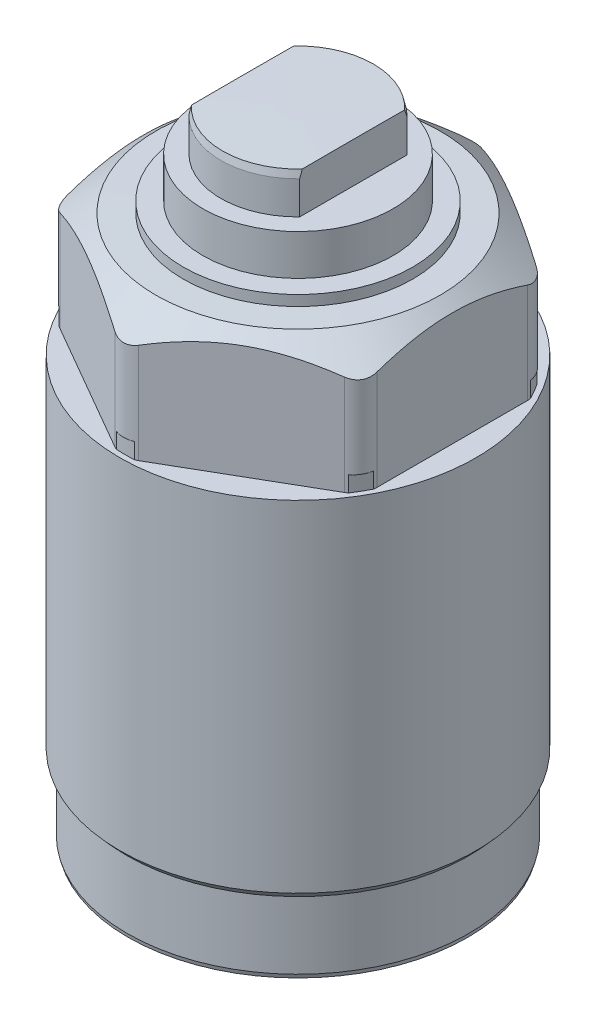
ISO-10303-21;
HEADER;
FILE_DESCRIPTION(('STEP AP214'),'2;1');
FILE_NAME('part.step','',(''),(''),'','','');
FILE_SCHEMA(('AUTOMOTIVE_DESIGN { 1 0 10303 214 1 1 1 1 }'));
ENDSEC;
DATA;
#1=APPLICATION_CONTEXT('core data for automotive mechanical design processes');
#2=APPLICATION_PROTOCOL_DEFINITION('international standard','automotive_design',2000,#1);
#3=PRODUCT_CONTEXT('',#1,'mechanical');
#4=PRODUCT('Part','Part','',(#3));
#5=PRODUCT_RELATED_PRODUCT_CATEGORY('part','',(#4));
#6=PRODUCT_DEFINITION_FORMATION('','',#4);
#7=PRODUCT_DEFINITION_CONTEXT('part definition',#1,'design');
#8=PRODUCT_DEFINITION('design','',#6,#7);
#9=PRODUCT_DEFINITION_SHAPE('','',#8);
#10=(LENGTH_UNIT() NAMED_UNIT(*) SI_UNIT(.MILLI.,.METRE.));
#11=(NAMED_UNIT(*) PLANE_ANGLE_UNIT() SI_UNIT($,.RADIAN.));
#12=(NAMED_UNIT(*) SI_UNIT($,.STERADIAN.) SOLID_ANGLE_UNIT());
#13=UNCERTAINTY_MEASURE_WITH_UNIT(LENGTH_MEASURE(1.E-05),#10,'distance_accuracy_value','');
#14=(GEOMETRIC_REPRESENTATION_CONTEXT(3) GLOBAL_UNCERTAINTY_ASSIGNED_CONTEXT((#13)) GLOBAL_UNIT_ASSIGNED_CONTEXT((#10,
#11,#12)) REPRESENTATION_CONTEXT('',''));
#15=CARTESIAN_POINT('',(0.,0.,0.));
#16=DIRECTION('',(0.,0.,1.));
#17=DIRECTION('',(1.,0.,0.));
#18=AXIS2_PLACEMENT_3D('',#15,#16,#17);
#19=CARTESIAN_POINT('',(0.,78.5432459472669,0.));
#20=DIRECTION('',(0.,-1.,0.));
#21=DIRECTION('',(0.,0.,-1.));
#22=AXIS2_PLACEMENT_3D('',#19,#20,#21);
#23=CONICAL_SURFACE('',#22,0.,1.56438652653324);
#24=CARTESIAN_POINT('',(0.,78.5432459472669,0.));
#25=VERTEX_POINT('',#24);
#26=VERTEX_LOOP('',#25);
#27=FACE_BOUND('',#26,.T.);
#28=CARTESIAN_POINT('',(0.,78.4821820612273,0.));
#29=DIRECTION('',(0.,1.,0.));
#30=DIRECTION('',(0.,0.,1.));
#31=AXIS2_PLACEMENT_3D('',#28,#29,#30);
#32=CIRCLE('',#31,9.52651366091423);
#33=CARTESIAN_POINT('',(-7.,78.4821820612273,6.46176930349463));
#34=VERTEX_POINT('',#33);
#35=CARTESIAN_POINT('',(7.,78.4821820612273,6.46176930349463));
#36=VERTEX_POINT('',#35);
#37=EDGE_CURVE('E522',#34,#36,#32,.T.);
#38=ORIENTED_EDGE('',*,*,#37,.T.);
#39=CARTESIAN_POINT('',(7.00000000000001,78.2997084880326,37.3436217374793));
#40=CARTESIAN_POINT('',(7.00000000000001,78.3095130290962,35.7876420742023));
#41=CARTESIAN_POINT('',(7.00000000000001,78.3192952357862,34.2316622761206));
#42=CARTESIAN_POINT('',(7.00000000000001,78.3387973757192,31.1197016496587));
#43=CARTESIAN_POINT('',(7.,78.3485173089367,29.5637208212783));
#44=CARTESIAN_POINT('',(7.,78.3775575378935,24.8957359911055));
#45=CARTESIAN_POINT('',(7.,78.3967579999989,21.783731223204));
#46=CARTESIAN_POINT('',(7.,78.4247629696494,17.1157278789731));
#47=CARTESIAN_POINT('',(7.,78.4339653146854,15.5597316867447));
#48=CARTESIAN_POINT('',(7.,78.4518225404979,12.4477340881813));
#49=CARTESIAN_POINT('',(7.,78.4604774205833,10.8917326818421));
#50=CARTESIAN_POINT('',(7.,78.4724387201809,8.55773137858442));
#51=CARTESIAN_POINT('',(7.,78.4762556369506,7.77973413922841));
#52=CARTESIAN_POINT('',(7.,78.4833112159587,6.22373684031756));
#53=CARTESIAN_POINT('',(7.,78.4865498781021,5.44573678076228));
#54=CARTESIAN_POINT('',(7.,78.4920822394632,3.88973487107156));
#55=CARTESIAN_POINT('',(7.,78.4943759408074,3.11173302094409));
#56=CARTESIAN_POINT('',(7.,78.4975217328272,1.55572653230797));
#57=CARTESIAN_POINT('',(7.,78.498373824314,0.777721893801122));
#58=CARTESIAN_POINT('',(7.,78.4983785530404,-0.488012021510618));
#59=CARTESIAN_POINT('',(7.,78.4980466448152,-0.975741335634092));
#60=CARTESIAN_POINT('',(7.,78.4967665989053,-1.95119939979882));
#61=CARTESIAN_POINT('',(7.,78.4958184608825,-2.43892814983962));
#62=CARTESIAN_POINT('',(7.,78.4934074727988,-3.41438361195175));
#63=CARTESIAN_POINT('',(7.,78.4919446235,-3.90211032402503));
#64=CARTESIAN_POINT('',(7.,78.4886225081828,-4.87756234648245));
#65=CARTESIAN_POINT('',(7.,78.4867632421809,-5.36528765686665));
#66=CARTESIAN_POINT('',(7.,78.4816329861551,-6.61339429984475));
#67=CARTESIAN_POINT('',(7.,78.4781538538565,-7.3737747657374));
#68=CARTESIAN_POINT('',(7.,78.4707629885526,-8.89453361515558));
#69=CARTESIAN_POINT('',(7.,78.4668512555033,-9.65491199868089));
#70=CARTESIAN_POINT('',(7.,78.4547216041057,-11.9360476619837));
#71=CARTESIAN_POINT('',(7.,78.4461092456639,-13.4568028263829));
#72=CARTESIAN_POINT('',(7.,78.4290256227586,-16.3972187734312));
#73=CARTESIAN_POINT('',(7.,78.4205830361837,-17.8168797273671));
#74=CARTESIAN_POINT('',(7.,78.4034806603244,-20.656200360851));
#75=CARTESIAN_POINT('',(7.,78.3948208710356,-22.075860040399));
#76=CARTESIAN_POINT('',(7.,78.3686596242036,-26.3348380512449));
#77=CARTESIAN_POINT('',(7.,78.3509762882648,-29.1741552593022));
#78=CARTESIAN_POINT('',(7.,78.3154137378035,-34.8527666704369));
#79=CARTESIAN_POINT('',(7.,78.2975345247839,-37.6920608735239));
#80=CARTESIAN_POINT('',(6.99999999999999,78.261662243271,-43.3706483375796));
#81=CARTESIAN_POINT('',(6.99999999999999,78.2436691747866,-46.2099415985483));
#82=CARTESIAN_POINT('',(6.99999999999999,78.2256602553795,-49.0492347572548));
#83=B_SPLINE_CURVE_WITH_KNOTS('',3,(#39,#40,#41,#42,#43,#44,#45,#46,#47,#48,#49,#50,#51,#52,#53,
#54,#55,#56,#57,#58,#59,#60,#61,#62,#63,#64,#65,#66,#67,#68,#69,#70,#71,#72,#73,#74,#75,#76,#77,
#78,#79,#80,#81,#82),.UNSPECIFIED.,.F.,.F.,(4,2,2,2,2,2,2,2,2,2,2,2,2,2,2,2,2,2,2,2,2,4),(0.,
4.66803164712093,9.33606521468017,18.6722570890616,23.3403272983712,28.0084034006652,
30.3424230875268,32.6764431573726,35.0104579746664,37.3444714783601,38.8076593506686,
40.2708480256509,41.734034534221,43.1972209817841,45.4783860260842,47.759551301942,
52.3218897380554,56.5809479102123,60.8400061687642,69.3581229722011,77.8761744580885,
86.3942252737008),.UNSPECIFIED.);
#84=CARTESIAN_POINT('',(7.,78.4821820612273,-6.46176930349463));
#85=VERTEX_POINT('',#84);
#86=EDGE_CURVE('E464',#36,#85,#83,.T.);
#87=ORIENTED_EDGE('',*,*,#86,.T.);
#88=CARTESIAN_POINT('',(-7.,78.4821820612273,-6.46176930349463));
#89=VERTEX_POINT('',#88);
#90=EDGE_CURVE('E521',#85,#89,#32,.T.);
#91=ORIENTED_EDGE('',*,*,#90,.T.);
#92=CARTESIAN_POINT('',(-7.00000000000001,78.2256602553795,-49.0492347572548));
#93=CARTESIAN_POINT('',(-7.00000000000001,78.2370801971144,-47.249401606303));
#94=CARTESIAN_POINT('',(-7.00000000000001,78.2484896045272,-45.4495683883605));
#95=CARTESIAN_POINT('',(-7.00000000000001,78.2712725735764,-41.8499016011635));
#96=CARTESIAN_POINT('',(-7.,78.2826461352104,-40.0500680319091));
#97=CARTESIAN_POINT('',(-7.,78.3053426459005,-36.4503986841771));
#98=CARTESIAN_POINT('',(-7.,78.3166655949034,-34.6505629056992));
#99=CARTESIAN_POINT('',(-7.,78.3392325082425,-31.0508909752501));
#100=CARTESIAN_POINT('',(-7.,78.3504764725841,-29.2510548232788));
#101=CARTESIAN_POINT('',(-7.,78.3728356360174,-25.6513728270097));
#102=CARTESIAN_POINT('',(-7.,78.3839508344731,-23.8515269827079));
#103=CARTESIAN_POINT('',(-7.,78.4059421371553,-20.2518334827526));
#104=CARTESIAN_POINT('',(-7.,78.4168182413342,-18.4519858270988));
#105=CARTESIAN_POINT('',(-7.,78.438102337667,-14.8522882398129));
#106=CARTESIAN_POINT('',(-7.,78.4485103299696,-13.0524383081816));
#107=CARTESIAN_POINT('',(-7.,78.4631961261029,-10.3526586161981));
#108=CARTESIAN_POINT('',(-7.,78.4679370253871,-9.45273140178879));
#109=CARTESIAN_POINT('',(-7.,78.4768685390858,-7.65287427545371));
#110=CARTESIAN_POINT('',(-7.,78.4810591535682,-6.75294436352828));
#111=CARTESIAN_POINT('',(-7.,78.4878841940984,-5.0926241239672));
#112=CARTESIAN_POINT('',(-7.,78.4906591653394,-4.33223439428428));
#113=CARTESIAN_POINT('',(-7.,78.4950868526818,-2.81145229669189));
#114=CARTESIAN_POINT('',(-7.,78.4967395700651,-2.05105992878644));
#115=CARTESIAN_POINT('',(-7.,78.498501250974,-0.530273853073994));
#116=CARTESIAN_POINT('',(-7.,78.498610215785,0.230119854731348));
#117=CARTESIAN_POINT('',(-7.,78.4972492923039,1.75090639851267));
#118=CARTESIAN_POINT('',(-7.,78.4957794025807,2.51129923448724));
#119=CARTESIAN_POINT('',(-7.,78.4917932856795,3.9815248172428));
#120=CARTESIAN_POINT('',(-7.,78.4893531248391,4.69135778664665));
#121=CARTESIAN_POINT('',(-7.,78.4837921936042,6.11102111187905));
#122=CARTESIAN_POINT('',(-7.,78.4806714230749,6.82085146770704));
#123=CARTESIAN_POINT('',(-7.,78.470683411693,8.95034052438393));
#124=CARTESIAN_POINT('',(-7.,78.4631904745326,10.3699962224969));
#125=CARTESIAN_POINT('',(-7.,78.4475274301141,13.2093069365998));
#126=CARTESIAN_POINT('',(-7.,78.4393573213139,14.6289619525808));
#127=CARTESIAN_POINT('',(-7.,78.4226756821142,17.4682693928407));
#128=CARTESIAN_POINT('',(-7.,78.4141641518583,18.8879218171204));
#129=CARTESIAN_POINT('',(-7.,78.3969566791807,21.7272486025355));
#130=CARTESIAN_POINT('',(-7.,78.3882607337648,23.1469229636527));
#131=CARTESIAN_POINT('',(-7.,78.3707573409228,25.986271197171));
#132=CARTESIAN_POINT('',(-7.,78.3619498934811,27.4059450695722));
#133=CARTESIAN_POINT('',(-7.,78.3442641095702,30.2452863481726));
#134=CARTESIAN_POINT('',(-6.99999999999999,78.335385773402,31.6649537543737));
#135=CARTESIAN_POINT('',(-6.99999999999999,78.3175792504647,34.504288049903));
#136=CARTESIAN_POINT('',(-6.99999999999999,78.3086510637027,35.9239549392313));
#137=CARTESIAN_POINT('',(-6.99999999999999,78.2997084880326,37.3436217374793));
#138=B_SPLINE_CURVE_WITH_KNOTS('',3,(#92,#93,#94,#95,#96,#97,#98,#99,#100,#101,#102,#103,#104,
#105,#106,#107,#108,#109,#110,#111,#112,#113,#114,#115,#116,#117,#118,#119,#120,#121,#122,#123,
#124,#125,#126,#127,#128,#129,#130,#131,#132,#133,#134,#135,#136,#137),.UNSPECIFIED.,.F.,.F.,(4,
2,2,2,2,2,2,2,2,2,2,2,2,2,2,2,2,2,2,2,2,2,4),(0.,5.3996081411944,10.7992166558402,
16.1988308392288,21.5984446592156,26.9980851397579,32.3977266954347,37.7973665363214,
40.4971855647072,43.1970042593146,45.4781881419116,47.7593694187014,50.0405487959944,
52.3217302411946,54.4512412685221,56.5807527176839,60.8397785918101,65.0988141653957,
69.3578479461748,73.6169509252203,77.876054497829,82.1351400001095,86.3942248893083),.UNSPECIFIED.);
#139=EDGE_CURVE('E456',#89,#34,#138,.T.);
#140=ORIENTED_EDGE('',*,*,#139,.T.);
#141=EDGE_LOOP('',(#38,#87,#91,#140));
#142=FACE_BOUND('',#141,.T.);
#143=ADVANCED_FACE('F33',(#27,#142),#23,.T.);
#144=CARTESIAN_POINT('',(0.,78.4821820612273,0.));
#145=DIRECTION('',(0.,-1.,0.));
#146=DIRECTION('',(0.,0.,-1.));
#147=AXIS2_PLACEMENT_3D('',#144,#145,#146);
#148=CONICAL_SURFACE('',#147,9.52651366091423,0.240269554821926);
#149=CARTESIAN_POINT('',(0.,77.5700004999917,0.));
#150=DIRECTION('',(0.,1.,0.));
#151=DIRECTION('',(0.,0.,1.));
#152=AXIS2_PLACEMENT_3D('',#149,#150,#151);
#153=CIRCLE('',#152,9.75000035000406);
#154=CARTESIAN_POINT('',(-7.,77.5700004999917,6.78693648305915));
#155=VERTEX_POINT('',#154);
#156=CARTESIAN_POINT('',(7.,77.5700004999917,6.78693648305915));
#157=VERTEX_POINT('',#156);
#158=EDGE_CURVE('E259',#155,#157,#153,.T.);
#159=ORIENTED_EDGE('',*,*,#158,.T.);
#160=CARTESIAN_POINT('',(7.,66.065408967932,10.43891952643));
#161=CARTESIAN_POINT('',(7.,66.4480600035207,10.3260403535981));
#162=CARTESIAN_POINT('',(7.,66.8305579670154,10.2126426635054));
#163=CARTESIAN_POINT('',(7.,67.5952118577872,9.98469541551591));
#164=CARTESIAN_POINT('',(7.,67.9773677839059,9.87014585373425));
#165=CARTESIAN_POINT('',(7.,69.1234446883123,9.52454401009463));
#166=CARTESIAN_POINT('',(7.,69.8867945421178,9.29159162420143));
#167=CARTESIAN_POINT('',(7.,71.4180753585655,8.81740282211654));
#168=CARTESIAN_POINT('',(7.,72.1859896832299,8.57611260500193));
#169=CARTESIAN_POINT('',(7.,73.7190994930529,8.08551195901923));
#170=CARTESIAN_POINT('',(7.,74.4842954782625,7.83620310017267));
#171=CARTESIAN_POINT('',(7.,75.673353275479,7.43968912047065));
#172=CARTESIAN_POINT('',(7.,76.0984271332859,7.29611868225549));
#173=CARTESIAN_POINT('',(7.,76.9472450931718,7.00509891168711));
#174=CARTESIAN_POINT('',(7.,77.3709892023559,6.85764960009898));
#175=CARTESIAN_POINT('',(7.,78.2171176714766,6.55802729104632));
#176=CARTESIAN_POINT('',(7.,78.6395009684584,6.40585128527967));
#177=CARTESIAN_POINT('',(7.,79.4821905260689,6.09588274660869));
#178=CARTESIAN_POINT('',(7.,79.9024968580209,5.93809040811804));
#179=CARTESIAN_POINT('',(7.,80.7386573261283,5.61623958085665));
#180=CARTESIAN_POINT('',(7.,81.1545228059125,5.45221069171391));
#181=CARTESIAN_POINT('',(7.,81.982688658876,5.11542486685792));
#182=CARTESIAN_POINT('',(7.,82.3949892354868,4.94266843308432));
#183=CARTESIAN_POINT('',(7.,83.214273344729,4.58594309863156));
#184=CARTESIAN_POINT('',(7.,83.6212618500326,4.40198575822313));
#185=CARTESIAN_POINT('',(7.,84.2261534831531,4.11442803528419));
#186=CARTESIAN_POINT('',(7.,84.426826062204,4.01665217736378));
#187=CARTESIAN_POINT('',(7.,84.8258326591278,3.81644990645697));
#188=CARTESIAN_POINT('',(7.,85.0241668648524,3.71402387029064));
#189=CARTESIAN_POINT('',(7.,85.3149699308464,3.55853599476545));
#190=CARTESIAN_POINT('',(7.,85.4086022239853,3.50764700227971));
#191=CARTESIAN_POINT('',(7.,85.5950829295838,3.40444395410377));
#192=CARTESIAN_POINT('',(7.,85.6879313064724,3.35212983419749));
#193=CARTESIAN_POINT('',(7.,85.9651962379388,3.19279338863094));
#194=CARTESIAN_POINT('',(7.,86.1482709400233,3.08340967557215));
#195=CARTESIAN_POINT('',(7.,86.5082724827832,2.85760002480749));
#196=CARTESIAN_POINT('',(7.,86.6852333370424,2.7412286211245));
#197=CARTESIAN_POINT('',(7.,87.0322687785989,2.49868503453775));
#198=CARTESIAN_POINT('',(7.,87.2023471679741,2.37251837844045));
#199=CARTESIAN_POINT('',(7.,87.5054057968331,2.12887863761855));
#200=CARTESIAN_POINT('',(7.,87.6399206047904,2.01332931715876));
#201=CARTESIAN_POINT('',(7.,87.898802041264,1.77027712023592));
#202=CARTESIAN_POINT('',(7.,88.0231351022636,1.64273746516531));
#203=CARTESIAN_POINT('',(7.,88.1979134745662,1.43933909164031));
#204=CARTESIAN_POINT('',(7.,88.2546277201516,1.36890673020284));
#205=CARTESIAN_POINT('',(7.,88.3624378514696,1.22388680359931));
#206=CARTESIAN_POINT('',(7.,88.4135318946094,1.14929788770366));
#207=CARTESIAN_POINT('',(7.,88.5555391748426,0.919439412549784));
#208=CARTESIAN_POINT('',(7.,88.6360758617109,0.75709548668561));
#209=CARTESIAN_POINT('',(7.,88.7266997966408,0.491437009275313));
#210=CARTESIAN_POINT('',(7.,88.7521934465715,0.393378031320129));
#211=CARTESIAN_POINT('',(7.,88.7862372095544,0.194352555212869));
#212=CARTESIAN_POINT('',(7.,88.7948065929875,0.0933894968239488));
#213=CARTESIAN_POINT('',(7.,88.7939214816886,-0.108600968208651));
#214=CARTESIAN_POINT('',(7.,88.7844401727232,-0.20962824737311));
#215=CARTESIAN_POINT('',(7.,88.7486203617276,-0.408676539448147));
#216=CARTESIAN_POINT('',(7.,88.722259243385,-0.506693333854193));
#217=CARTESIAN_POINT('',(7.,88.6429349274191,-0.733453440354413));
#218=CARTESIAN_POINT('',(7.,88.583708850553,-0.859972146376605));
#219=CARTESIAN_POINT('',(7.,88.4464930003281,-1.10229366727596));
#220=CARTESIAN_POINT('',(7.,88.3684593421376,-1.21807052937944));
#221=CARTESIAN_POINT('',(7.,88.2034531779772,-1.4348046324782));
#222=CARTESIAN_POINT('',(7.,88.1170342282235,-1.53619243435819));
#223=CARTESIAN_POINT('',(7.,87.9359508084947,-1.73139245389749));
#224=CARTESIAN_POINT('',(7.,87.8412780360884,-1.82519685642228));
#225=CARTESIAN_POINT('',(7.,87.6457209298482,-2.0066950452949));
#226=CARTESIAN_POINT('',(7.,87.54481707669,-2.094367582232));
#227=CARTESIAN_POINT('',(7.,87.3386556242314,-2.26427595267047));
#228=CARTESIAN_POINT('',(7.,87.2334002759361,-2.3465145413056));
#229=CARTESIAN_POINT('',(7.,86.9187906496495,-2.58189401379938));
#230=CARTESIAN_POINT('',(7.,86.7048008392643,-2.72882623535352));
#231=CARTESIAN_POINT('',(7.,86.2688234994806,-3.01039695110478));
#232=CARTESIAN_POINT('',(7.,86.0468301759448,-3.1450262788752));
#233=CARTESIAN_POINT('',(7.,85.5969188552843,-3.40514214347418));
#234=CARTESIAN_POINT('',(7.,85.3689887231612,-3.53060756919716));
#235=CARTESIAN_POINT('',(7.,84.9091960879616,-3.77412547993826));
#236=CARTESIAN_POINT('',(7.,84.677333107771,-3.89217705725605));
#237=CARTESIAN_POINT('',(7.,84.2087671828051,-4.12324621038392));
#238=CARTESIAN_POINT('',(7.,83.9720401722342,-4.23621477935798));
#239=CARTESIAN_POINT('',(7.,83.4962666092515,-4.45717958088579));
#240=CARTESIAN_POINT('',(7.,83.2572199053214,-4.56517548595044));
#241=CARTESIAN_POINT('',(7.,82.777662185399,-4.77684898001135));
#242=CARTESIAN_POINT('',(7.,82.5371539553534,-4.88053289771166));
#243=CARTESIAN_POINT('',(7.,82.0546624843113,-5.08438476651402));
#244=CARTESIAN_POINT('',(7.,81.8126792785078,-5.18455280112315));
#245=CARTESIAN_POINT('',(7.,81.2471190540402,-5.41456683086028));
#246=CARTESIAN_POINT('',(7.,80.9230697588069,-5.54325083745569));
#247=CARTESIAN_POINT('',(7.,80.2732469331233,-5.79619603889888));
#248=CARTESIAN_POINT('',(7.,79.9474733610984,-5.92045712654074));
#249=CARTESIAN_POINT('',(7.,78.9680158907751,-6.28770675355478));
#250=CARTESIAN_POINT('',(7.,78.3122487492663,-6.52514019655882));
#251=CARTESIAN_POINT('',(7.,76.9961645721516,-6.98939027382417));
#252=CARTESIAN_POINT('',(7.,76.3358432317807,-7.21619460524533));
#253=CARTESIAN_POINT('',(7.,75.0124234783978,-7.6614200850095));
#254=CARTESIAN_POINT('',(7.,74.3493252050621,-7.87984164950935));
#255=CARTESIAN_POINT('',(7.,73.0525262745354,-8.29987194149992));
#256=CARTESIAN_POINT('',(7.,72.4189243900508,-8.50178657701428));
#257=CARTESIAN_POINT('',(7.,71.1501756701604,-8.90073427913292));
#258=CARTESIAN_POINT('',(7.,70.5150288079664,-9.09776726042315));
#259=CARTESIAN_POINT('',(7.,69.2447040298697,-9.48742305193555));
#260=CARTESIAN_POINT('',(7.,68.6095284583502,-9.68005351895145));
#261=CARTESIAN_POINT('',(7.,67.3381746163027,-10.0618955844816));
#262=CARTESIAN_POINT('',(7.,66.7019963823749,-10.2511073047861));
#263=CARTESIAN_POINT('',(7.,66.065408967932,-10.43891952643));
#264=B_SPLINE_CURVE_WITH_KNOTS('',3,(#160,#161,#162,#163,#164,#165,#166,#167,#168,#169,#170,
#171,#172,#173,#174,#175,#176,#177,#178,#179,#180,#181,#182,#183,#184,#185,#186,#187,#188,#189,
#190,#191,#192,#193,#194,#195,#196,#197,#198,#199,#200,#201,#202,#203,#204,#205,#206,#207,#208,
#209,#210,#211,#212,#213,#214,#215,#216,#217,#218,#219,#220,#221,#222,#223,#224,#225,#226,#227,
#228,#229,#230,#231,#232,#233,#234,#235,#236,#237,#238,#239,#240,#241,#242,#243,#244,#245,#246,
#247,#248,#249,#250,#251,#252,#253,#254,#255,#256,#257,#258,#259,#260,#261,#262,#263),
.UNSPECIFIED.,.F.,.F.,(4,2,2,2,2,2,2,2,2,2,2,2,2,2,2,2,2,2,2,2,2,2,2,2,2,2,2,2,2,2,2,2,2,2,2,2,
2,2,2,2,2,2,2,2,2,2,2,2,2,2,2,4),(0.,1.19685831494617,2.39372066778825,4.78800905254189,
7.2027696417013,9.61706027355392,10.9630404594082,12.3090134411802,13.6558613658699,
15.0026627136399,16.3437192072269,17.684698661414,19.0243168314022,19.6939492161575,
20.3635274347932,20.6832197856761,21.0029265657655,21.6425493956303,22.2777039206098,
22.9125026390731,23.4440507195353,23.9772860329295,24.2483096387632,24.5194218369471,
25.0576942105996,25.3604252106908,25.6628113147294,25.9656469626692,26.2688892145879,
26.6855876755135,27.1032680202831,27.5023286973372,27.9017955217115,28.3025843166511,
28.7031683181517,29.4812123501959,30.2598314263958,31.0401910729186,31.8206460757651,
32.6074773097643,33.3943602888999,34.1800443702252,34.9657097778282,36.0116636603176,
37.0576428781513,39.1497742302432,41.2442701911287,43.3386620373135,45.3336299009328,
47.3286326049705,49.3198509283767,51.3109981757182),.UNSPECIFIED.);
#265=EDGE_CURVE('E471',#157,#36,#264,.T.);
#266=ORIENTED_EDGE('',*,*,#265,.T.);
#267=ORIENTED_EDGE('',*,*,#37,.F.);
#268=CARTESIAN_POINT('',(-7.,66.065408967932,-10.4389195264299));
#269=CARTESIAN_POINT('',(-7.,66.4480600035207,-10.3260403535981));
#270=CARTESIAN_POINT('',(-7.,66.8305579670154,-10.2126426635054));
#271=CARTESIAN_POINT('',(-7.,67.5952118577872,-9.98469541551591));
#272=CARTESIAN_POINT('',(-7.,67.9773677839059,-9.87014585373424));
#273=CARTESIAN_POINT('',(-7.,69.1234446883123,-9.52454401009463));
#274=CARTESIAN_POINT('',(-7.,69.8867945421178,-9.29159162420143));
#275=CARTESIAN_POINT('',(-7.,71.4180753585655,-8.81740282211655));
#276=CARTESIAN_POINT('',(-7.,72.1859896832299,-8.57611260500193));
#277=CARTESIAN_POINT('',(-7.,73.7190994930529,-8.08551195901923));
#278=CARTESIAN_POINT('',(-7.,74.4842954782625,-7.83620310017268));
#279=CARTESIAN_POINT('',(-7.,75.673353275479,-7.43968912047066));
#280=CARTESIAN_POINT('',(-7.,76.0984271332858,-7.2961186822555));
#281=CARTESIAN_POINT('',(-7.,76.9472450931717,-7.00509891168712));
#282=CARTESIAN_POINT('',(-7.,77.3709892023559,-6.85764960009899));
#283=CARTESIAN_POINT('',(-7.,78.2171176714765,-6.55802729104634));
#284=CARTESIAN_POINT('',(-7.,78.6395009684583,-6.40585128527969));
#285=CARTESIAN_POINT('',(-7.,79.4821905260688,-6.09588274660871));
#286=CARTESIAN_POINT('',(-7.,79.9024968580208,-5.93809040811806));
#287=CARTESIAN_POINT('',(-7.,80.7386573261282,-5.61623958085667));
#288=CARTESIAN_POINT('',(-7.,81.1545228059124,-5.45221069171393));
#289=CARTESIAN_POINT('',(-7.,81.9826886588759,-5.11542486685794));
#290=CARTESIAN_POINT('',(-7.,82.3949892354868,-4.94266843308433));
#291=CARTESIAN_POINT('',(-7.,83.214273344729,-4.58594309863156));
#292=CARTESIAN_POINT('',(-7.,83.6212618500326,-4.40198575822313));
#293=CARTESIAN_POINT('',(-7.,84.2261534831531,-4.11442803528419));
#294=CARTESIAN_POINT('',(-7.,84.426826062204,-4.01665217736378));
#295=CARTESIAN_POINT('',(-7.,84.8258326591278,-3.81644990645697));
#296=CARTESIAN_POINT('',(-7.,85.0241668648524,-3.71402387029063));
#297=CARTESIAN_POINT('',(-7.,85.3149699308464,-3.55853599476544));
#298=CARTESIAN_POINT('',(-7.,85.4086022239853,-3.50764700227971));
#299=CARTESIAN_POINT('',(-7.,85.5950829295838,-3.40444395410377));
#300=CARTESIAN_POINT('',(-7.,85.6879313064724,-3.3521298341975));
#301=CARTESIAN_POINT('',(-7.,85.9651962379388,-3.19279338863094));
#302=CARTESIAN_POINT('',(-7.,86.1482709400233,-3.08340967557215));
#303=CARTESIAN_POINT('',(-7.,86.5082724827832,-2.85760002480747));
#304=CARTESIAN_POINT('',(-7.,86.6852333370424,-2.74122862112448));
#305=CARTESIAN_POINT('',(-7.,87.0322687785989,-2.49868503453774));
#306=CARTESIAN_POINT('',(-7.,87.2023471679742,-2.37251837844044));
#307=CARTESIAN_POINT('',(-7.,87.5054057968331,-2.12887863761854));
#308=CARTESIAN_POINT('',(-7.,87.6399206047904,-2.01332931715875));
#309=CARTESIAN_POINT('',(-7.,87.898802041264,-1.77027712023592));
#310=CARTESIAN_POINT('',(-7.,88.0231351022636,-1.64273746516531));
#311=CARTESIAN_POINT('',(-7.,88.1979134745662,-1.43933909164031));
#312=CARTESIAN_POINT('',(-7.,88.2546277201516,-1.36890673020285));
#313=CARTESIAN_POINT('',(-7.,88.3624378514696,-1.22388680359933));
#314=CARTESIAN_POINT('',(-7.,88.4135318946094,-1.14929788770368));
#315=CARTESIAN_POINT('',(-7.,88.5555391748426,-0.919439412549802));
#316=CARTESIAN_POINT('',(-7.,88.6360758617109,-0.757095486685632));
#317=CARTESIAN_POINT('',(-7.,88.7266997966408,-0.491437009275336));
#318=CARTESIAN_POINT('',(-7.,88.7521934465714,-0.393378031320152));
#319=CARTESIAN_POINT('',(-7.,88.7862372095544,-0.194352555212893));
#320=CARTESIAN_POINT('',(-7.,88.7948065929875,-0.0933894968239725));
#321=CARTESIAN_POINT('',(-7.,88.7939214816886,0.108600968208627));
#322=CARTESIAN_POINT('',(-7.,88.7844401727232,0.209628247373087));
#323=CARTESIAN_POINT('',(-7.,88.7486203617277,0.408676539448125));
#324=CARTESIAN_POINT('',(-7.,88.722259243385,0.506693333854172));
#325=CARTESIAN_POINT('',(-7.,88.6429349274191,0.733453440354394));
#326=CARTESIAN_POINT('',(-7.,88.583708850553,0.859972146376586));
#327=CARTESIAN_POINT('',(-7.,88.4464930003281,1.10229366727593));
#328=CARTESIAN_POINT('',(-7.,88.3684593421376,1.21807052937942));
#329=CARTESIAN_POINT('',(-7.,88.2034531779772,1.43480463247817));
#330=CARTESIAN_POINT('',(-7.,88.1170342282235,1.53619243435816));
#331=CARTESIAN_POINT('',(-7.,87.9359508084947,1.73139245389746));
#332=CARTESIAN_POINT('',(-7.,87.8412780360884,1.82519685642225));
#333=CARTESIAN_POINT('',(-7.,87.6457209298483,2.00669504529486));
#334=CARTESIAN_POINT('',(-7.,87.5448170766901,2.09436758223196));
#335=CARTESIAN_POINT('',(-7.,87.3386556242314,2.26427595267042));
#336=CARTESIAN_POINT('',(-7.,87.2334002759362,2.34651454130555));
#337=CARTESIAN_POINT('',(-7.,86.9187906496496,2.58189401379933));
#338=CARTESIAN_POINT('',(-7.,86.7048008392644,2.72882623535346));
#339=CARTESIAN_POINT('',(-7.,86.2688234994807,3.01039695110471));
#340=CARTESIAN_POINT('',(-7.,86.0468301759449,3.14502627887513));
#341=CARTESIAN_POINT('',(-7.,85.5969188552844,3.4051421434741));
#342=CARTESIAN_POINT('',(-7.,85.3689887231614,3.53060756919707));
#343=CARTESIAN_POINT('',(-7.,84.9091960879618,3.77412547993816));
#344=CARTESIAN_POINT('',(-7.,84.6773331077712,3.89217705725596));
#345=CARTESIAN_POINT('',(-7.,84.2087671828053,4.12324621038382));
#346=CARTESIAN_POINT('',(-7.,83.9720401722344,4.23621477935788));
#347=CARTESIAN_POINT('',(-7.,83.4962666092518,4.45717958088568));
#348=CARTESIAN_POINT('',(-7.,83.2572199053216,4.56517548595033));
#349=CARTESIAN_POINT('',(-7.,82.7776621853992,4.77684898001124));
#350=CARTESIAN_POINT('',(-7.,82.5371539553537,4.88053289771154));
#351=CARTESIAN_POINT('',(-7.,82.0546624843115,5.0843847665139));
#352=CARTESIAN_POINT('',(-7.,81.8126792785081,5.18455280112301));
#353=CARTESIAN_POINT('',(-7.,81.2471190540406,5.41456683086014));
#354=CARTESIAN_POINT('',(-7.,80.9230697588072,5.54325083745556));
#355=CARTESIAN_POINT('',(-7.,80.2732469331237,5.79619603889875));
#356=CARTESIAN_POINT('',(-7.,79.9474733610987,5.92045712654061));
#357=CARTESIAN_POINT('',(-7.,78.9680158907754,6.28770675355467));
#358=CARTESIAN_POINT('',(-7.,78.3122487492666,6.52514019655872));
#359=CARTESIAN_POINT('',(-7.,76.9961645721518,6.98939027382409));
#360=CARTESIAN_POINT('',(-7.,76.335843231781,7.21619460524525));
#361=CARTESIAN_POINT('',(-7.,75.012423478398,7.66142008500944));
#362=CARTESIAN_POINT('',(-7.,74.3493252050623,7.8798416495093));
#363=CARTESIAN_POINT('',(-7.,73.0525262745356,8.29987194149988));
#364=CARTESIAN_POINT('',(-7.,72.418924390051,8.50178657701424));
#365=CARTESIAN_POINT('',(-7.,71.1501756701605,8.90073427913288));
#366=CARTESIAN_POINT('',(-7.,70.5150288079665,9.09776726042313));
#367=CARTESIAN_POINT('',(-7.,69.2447040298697,9.48742305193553));
#368=CARTESIAN_POINT('',(-7.,68.6095284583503,9.68005351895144));
#369=CARTESIAN_POINT('',(-7.,67.3381746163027,10.0618955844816));
#370=CARTESIAN_POINT('',(-7.,66.7019963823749,10.2511073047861));
#371=CARTESIAN_POINT('',(-7.,66.065408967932,10.43891952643));
#372=B_SPLINE_CURVE_WITH_KNOTS('',3,(#268,#269,#270,#271,#272,#273,#274,#275,#276,#277,#278,
#279,#280,#281,#282,#283,#284,#285,#286,#287,#288,#289,#290,#291,#292,#293,#294,#295,#296,#297,
#298,#299,#300,#301,#302,#303,#304,#305,#306,#307,#308,#309,#310,#311,#312,#313,#314,#315,#316,
#317,#318,#319,#320,#321,#322,#323,#324,#325,#326,#327,#328,#329,#330,#331,#332,#333,#334,#335,
#336,#337,#338,#339,#340,#341,#342,#343,#344,#345,#346,#347,#348,#349,#350,#351,#352,#353,#354,
#355,#356,#357,#358,#359,#360,#361,#362,#363,#364,#365,#366,#367,#368,#369,#370,#371),
.UNSPECIFIED.,.F.,.F.,(4,2,2,2,2,2,2,2,2,2,2,2,2,2,2,2,2,2,2,2,2,2,2,2,2,2,2,2,2,2,2,2,2,2,2,2,
2,2,2,2,2,2,2,2,2,2,2,2,2,2,2,4),(0.,1.19685831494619,2.39372066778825,4.78800905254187,
7.20276964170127,9.61706027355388,10.9630404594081,12.3090134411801,13.6558613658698,
15.0026627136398,16.3437192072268,17.684698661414,19.0243168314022,19.6939492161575,
20.3635274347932,20.6832197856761,21.0029265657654,21.6425493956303,22.2777039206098,
22.9125026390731,23.4440507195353,23.9772860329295,24.2483096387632,24.5194218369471,
25.0576942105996,25.3604252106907,25.6628113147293,25.9656469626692,26.2688892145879,
26.6855876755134,27.1032680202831,27.5023286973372,27.9017955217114,28.302584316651,
28.7031683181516,29.4812123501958,30.2598314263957,31.0401910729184,31.8206460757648,
32.6074773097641,33.3943602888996,34.1800443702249,34.9657097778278,36.0116636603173,
37.057642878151,39.149774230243,41.2442701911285,43.3386620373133,45.3336299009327,
47.3286326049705,49.3198509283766,51.3109981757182),.UNSPECIFIED.);
#373=EDGE_CURVE('E493',#34,#155,#372,.T.);
#374=ORIENTED_EDGE('',*,*,#373,.T.);
#375=EDGE_LOOP('',(#159,#266,#267,#374));
#376=FACE_BOUND('',#375,.T.);
#377=ADVANCED_FACE('F440',(#376),#148,.T.);
#378=ORIENTED_EDGE('',*,*,#90,.F.);
#379=CARTESIAN_POINT('',(7.,77.5700004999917,-6.78693648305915));
#380=VERTEX_POINT('',#379);
#381=EDGE_CURVE('E253',#85,#380,#264,.T.);
#382=ORIENTED_EDGE('',*,*,#381,.T.);
#383=CARTESIAN_POINT('',(-7.,77.5700004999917,-6.78693648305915));
#384=VERTEX_POINT('',#383);
#385=EDGE_CURVE('E251',#380,#384,#153,.T.);
#386=ORIENTED_EDGE('',*,*,#385,.T.);
#387=EDGE_CURVE('E486',#384,#89,#372,.T.);
#388=ORIENTED_EDGE('',*,*,#387,.T.);
#389=EDGE_LOOP('',(#378,#382,#386,#388));
#390=FACE_BOUND('',#389,.T.);
#391=ADVANCED_FACE('F446',(#390),#148,.T.);
#392=CARTESIAN_POINT('',(0.,231.292322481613,0.));
#393=DIRECTION('',(0.,1.,0.));
#394=DIRECTION('',(0.,0.,1.));
#395=AXIS2_PLACEMENT_3D('',#392,#393,#394);
#396=CYLINDRICAL_SURFACE('',#395,9.75000035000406);
#397=ORIENTED_EDGE('',*,*,#385,.F.);
#398=DIRECTION('',(0.,1.,0.));
#399=VECTOR('',#398,1.);
#400=CARTESIAN_POINT('',(7.,231.292322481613,-6.78693648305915));
#401=LINE('',#400,#399);
#402=CARTESIAN_POINT('',(7.,73.4010881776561,-6.78693648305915));
#403=VERTEX_POINT('',#402);
#404=EDGE_CURVE('E236',#380,#403,#401,.F.);
#405=ORIENTED_EDGE('',*,*,#404,.T.);
#406=CARTESIAN_POINT('',(0.,73.4010881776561,0.));
#407=DIRECTION('',(0.,1.,0.));
#408=DIRECTION('',(0.,0.,1.));
#409=AXIS2_PLACEMENT_3D('',#406,#407,#408);
#410=CIRCLE('',#409,9.75000035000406);
#411=CARTESIAN_POINT('',(-7.,73.4010881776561,-6.78693648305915));
#412=VERTEX_POINT('',#411);
#413=EDGE_CURVE('E249',#403,#412,#410,.T.);
#414=ORIENTED_EDGE('',*,*,#413,.T.);
#415=DIRECTION('',(0.,1.,0.));
#416=VECTOR('',#415,1.);
#417=CARTESIAN_POINT('',(-7.,231.292322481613,-6.78693648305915));
#418=LINE('',#417,#416);
#419=EDGE_CURVE('E492',#412,#384,#418,.T.);
#420=ORIENTED_EDGE('',*,*,#419,.T.);
#421=EDGE_LOOP('',(#397,#405,#414,#420));
#422=FACE_BOUND('',#421,.T.);
#423=ADVANCED_FACE('F247',(#422),#396,.T.);
#424=CARTESIAN_POINT('',(-7.,73.4010881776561,6.78693648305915));
#425=VERTEX_POINT('',#424);
#426=CARTESIAN_POINT('',(7.,73.4010881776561,6.78693648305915));
#427=VERTEX_POINT('',#426);
#428=EDGE_CURVE('E258',#425,#427,#410,.T.);
#429=ORIENTED_EDGE('',*,*,#428,.T.);
#430=DIRECTION('',(0.,1.,0.));
#431=VECTOR('',#430,1.);
#432=CARTESIAN_POINT('',(7.,231.292322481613,6.78693648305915));
#433=LINE('',#432,#431);
#434=EDGE_CURVE('E239',#427,#157,#433,.T.);
#435=ORIENTED_EDGE('',*,*,#434,.T.);
#436=ORIENTED_EDGE('',*,*,#158,.F.);
#437=DIRECTION('',(0.,1.,0.));
#438=VECTOR('',#437,1.);
#439=CARTESIAN_POINT('',(-7.,231.292322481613,6.78693648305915));
#440=LINE('',#439,#438);
#441=EDGE_CURVE('E495',#155,#425,#440,.F.);
#442=ORIENTED_EDGE('',*,*,#441,.T.);
#443=EDGE_LOOP('',(#429,#435,#436,#442));
#444=FACE_BOUND('',#443,.T.);
#445=ADVANCED_FACE('F500',(#444),#396,.T.);
#446=CARTESIAN_POINT('',(0.,231.292322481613,0.));
#447=DIRECTION('',(0.,1.,0.));
#448=DIRECTION('',(0.,0.,1.));
#449=AXIS2_PLACEMENT_3D('',#446,#447,#448);
#450=CYLINDRICAL_SURFACE('',#449,21.8333333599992);
#451=CARTESIAN_POINT('',(0.,51.4033337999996,0.));
#452=DIRECTION('',(0.,1.,0.));
#453=DIRECTION('',(0.,0.,1.));
#454=AXIS2_PLACEMENT_3D('',#451,#452,#453);
#455=CIRCLE('',#454,21.8333333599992);
#456=CARTESIAN_POINT('',(1.16016580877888,51.4033337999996,-21.8024874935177));
#457=VERTEX_POINT('',#456);
#458=CARTESIAN_POINT('',(-1.16016580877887,51.4033337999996,-21.8024874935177));
#459=VERTEX_POINT('',#458);
#460=EDGE_CURVE('E736',#457,#459,#455,.T.);
#461=ORIENTED_EDGE('',*,*,#460,.T.);
#462=DIRECTION('',(0.,1.,0.));
#463=VECTOR('',#462,1.);
#464=CARTESIAN_POINT('',(-1.16016580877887,51.4033337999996,-21.8024874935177));
#465=LINE('',#464,#463);
#466=CARTESIAN_POINT('',(-1.1601658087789,53.4033337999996,-21.8024874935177));
#467=VERTEX_POINT('',#466);
#468=EDGE_CURVE('E700',#459,#467,#465,.T.);
#469=ORIENTED_EDGE('',*,*,#468,.T.);
#470=CARTESIAN_POINT('',(0.,53.4033337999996,0.));
#471=DIRECTION('',(0.,1.,0.));
#472=DIRECTION('',(0.,0.,1.));
#473=AXIS2_PLACEMENT_3D('',#470,#471,#472);
#474=CIRCLE('',#473,21.8333333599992);
#475=CARTESIAN_POINT('',(1.16016580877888,53.4033337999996,-21.8024874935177));
#476=VERTEX_POINT('',#475);
#477=EDGE_CURVE('E683',#476,#467,#474,.T.);
#478=ORIENTED_EDGE('',*,*,#477,.F.);
#479=DIRECTION('',(0.,1.,0.));
#480=VECTOR('',#479,1.);
#481=CARTESIAN_POINT('',(1.16016580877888,53.4033337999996,-21.8024874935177));
#482=LINE('',#481,#480);
#483=EDGE_CURVE('E702',#476,#457,#482,.F.);
#484=ORIENTED_EDGE('',*,*,#483,.T.);
#485=EDGE_LOOP('',(#461,#469,#478,#484));
#486=FACE_BOUND('',#485,.T.);
#487=ADVANCED_FACE('F537',(#486),#450,.T.);
#488=CARTESIAN_POINT('',(19.4615909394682,51.4033337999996,-9.89651068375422));
#489=VERTEX_POINT('',#488);
#490=CARTESIAN_POINT('',(18.3014251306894,51.4033337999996,-11.9059768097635));
#491=VERTEX_POINT('',#490);
#492=EDGE_CURVE('E290',#489,#491,#455,.T.);
#493=ORIENTED_EDGE('',*,*,#492,.T.);
#494=DIRECTION('',(0.,1.,0.));
#495=VECTOR('',#494,1.);
#496=CARTESIAN_POINT('',(18.3014251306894,51.4033337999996,-11.9059768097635));
#497=LINE('',#496,#495);
#498=CARTESIAN_POINT('',(18.3014251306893,53.4033337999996,-11.9059768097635));
#499=VERTEX_POINT('',#498);
#500=EDGE_CURVE('E711',#491,#499,#497,.T.);
#501=ORIENTED_EDGE('',*,*,#500,.T.);
#502=CARTESIAN_POINT('',(19.4615909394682,53.4033337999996,-9.89651068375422));
#503=VERTEX_POINT('',#502);
#504=EDGE_CURVE('E285',#503,#499,#474,.T.);
#505=ORIENTED_EDGE('',*,*,#504,.F.);
#506=DIRECTION('',(0.,1.,0.));
#507=VECTOR('',#506,1.);
#508=CARTESIAN_POINT('',(19.4615909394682,53.4033337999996,-9.89651068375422));
#509=LINE('',#508,#507);
#510=EDGE_CURVE('E713',#503,#489,#509,.F.);
#511=ORIENTED_EDGE('',*,*,#510,.T.);
#512=EDGE_LOOP('',(#493,#501,#505,#511));
#513=FACE_BOUND('',#512,.T.);
#514=ADVANCED_FACE('F759',(#513),#450,.T.);
#515=CARTESIAN_POINT('',(-18.3014251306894,51.4033337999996,-11.9059768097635));
#516=VERTEX_POINT('',#515);
#517=CARTESIAN_POINT('',(-19.4615909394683,51.4033337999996,-9.8965106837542));
#518=VERTEX_POINT('',#517);
#519=EDGE_CURVE('E288',#516,#518,#455,.T.);
#520=ORIENTED_EDGE('',*,*,#519,.T.);
#521=DIRECTION('',(0.,1.,0.));
#522=VECTOR('',#521,1.);
#523=CARTESIAN_POINT('',(-19.4615909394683,51.4033337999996,-9.8965106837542));
#524=LINE('',#523,#522);
#525=CARTESIAN_POINT('',(-19.4615909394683,53.4033337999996,-9.89651068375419));
#526=VERTEX_POINT('',#525);
#527=EDGE_CURVE('E603',#518,#526,#524,.T.);
#528=ORIENTED_EDGE('',*,*,#527,.T.);
#529=CARTESIAN_POINT('',(-18.3014251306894,53.4033337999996,-11.9059768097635));
#530=VERTEX_POINT('',#529);
#531=EDGE_CURVE('E284',#530,#526,#474,.T.);
#532=ORIENTED_EDGE('',*,*,#531,.F.);
#533=DIRECTION('',(0.,1.,0.));
#534=VECTOR('',#533,1.);
#535=CARTESIAN_POINT('',(-18.3014251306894,53.4033337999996,-11.9059768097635));
#536=LINE('',#535,#534);
#537=EDGE_CURVE('E688',#530,#516,#536,.F.);
#538=ORIENTED_EDGE('',*,*,#537,.T.);
#539=EDGE_LOOP('',(#520,#528,#532,#538));
#540=FACE_BOUND('',#539,.T.);
#541=ADVANCED_FACE('F735',(#540),#450,.T.);
#542=CARTESIAN_POINT('',(-19.4615909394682,51.4033337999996,9.89651068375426));
#543=VERTEX_POINT('',#542);
#544=CARTESIAN_POINT('',(-18.3014251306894,51.4033337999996,11.9059768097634));
#545=VERTEX_POINT('',#544);
#546=EDGE_CURVE('E286',#543,#545,#455,.T.);
#547=ORIENTED_EDGE('',*,*,#546,.T.);
#548=DIRECTION('',(0.,1.,0.));
#549=VECTOR('',#548,1.);
#550=CARTESIAN_POINT('',(-18.3014251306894,51.4033337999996,11.9059768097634));
#551=LINE('',#550,#549);
#552=CARTESIAN_POINT('',(-18.3014251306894,53.4033337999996,11.9059768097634));
#553=VERTEX_POINT('',#552);
#554=EDGE_CURVE('E623',#545,#553,#551,.T.);
#555=ORIENTED_EDGE('',*,*,#554,.T.);
#556=CARTESIAN_POINT('',(-19.4615909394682,53.4033337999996,9.89651068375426));
#557=VERTEX_POINT('',#556);
#558=EDGE_CURVE('E281',#557,#553,#474,.T.);
#559=ORIENTED_EDGE('',*,*,#558,.F.);
#560=DIRECTION('',(0.,1.,0.));
#561=VECTOR('',#560,1.);
#562=CARTESIAN_POINT('',(-19.4615909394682,53.4033337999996,9.89651068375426));
#563=LINE('',#562,#561);
#564=EDGE_CURVE('E55',#557,#543,#563,.F.);
#565=ORIENTED_EDGE('',*,*,#564,.T.);
#566=EDGE_LOOP('',(#547,#555,#559,#565));
#567=FACE_BOUND('',#566,.T.);
#568=ADVANCED_FACE('F659',(#567),#450,.T.);
#569=CARTESIAN_POINT('',(-1.16016580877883,51.4033337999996,21.8024874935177));
#570=VERTEX_POINT('',#569);
#571=CARTESIAN_POINT('',(1.16016580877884,51.4033337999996,21.8024874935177));
#572=VERTEX_POINT('',#571);
#573=EDGE_CURVE('E289',#570,#572,#455,.T.);
#574=ORIENTED_EDGE('',*,*,#573,.T.);
#575=DIRECTION('',(0.,1.,0.));
#576=VECTOR('',#575,1.);
#577=CARTESIAN_POINT('',(1.16016580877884,51.4033337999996,21.8024874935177));
#578=LINE('',#577,#576);
#579=CARTESIAN_POINT('',(1.16016580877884,53.4033337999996,21.8024874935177));
#580=VERTEX_POINT('',#579);
#581=EDGE_CURVE('E618',#572,#580,#578,.T.);
#582=ORIENTED_EDGE('',*,*,#581,.T.);
#583=CARTESIAN_POINT('',(-1.16016580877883,53.4033337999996,21.8024874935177));
#584=VERTEX_POINT('',#583);
#585=EDGE_CURVE('E280',#584,#580,#474,.T.);
#586=ORIENTED_EDGE('',*,*,#585,.F.);
#587=DIRECTION('',(0.,1.,0.));
#588=VECTOR('',#587,1.);
#589=CARTESIAN_POINT('',(-1.16016580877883,53.4033337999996,21.8024874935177));
#590=LINE('',#589,#588);
#591=EDGE_CURVE('E616',#584,#570,#590,.F.);
#592=ORIENTED_EDGE('',*,*,#591,.T.);
#593=EDGE_LOOP('',(#574,#582,#586,#592));
#594=FACE_BOUND('',#593,.T.);
#595=ADVANCED_FACE('F751',(#594),#450,.T.);
#596=CARTESIAN_POINT('',(18.3014251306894,51.4033337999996,11.9059768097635));
#597=VERTEX_POINT('',#596);
#598=CARTESIAN_POINT('',(19.4615909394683,51.4033337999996,9.89651068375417));
#599=VERTEX_POINT('',#598);
#600=EDGE_CURVE('E295',#597,#599,#455,.T.);
#601=ORIENTED_EDGE('',*,*,#600,.T.);
#602=DIRECTION('',(0.,1.,0.));
#603=VECTOR('',#602,1.);
#604=CARTESIAN_POINT('',(19.4615909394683,51.4033337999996,9.89651068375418));
#605=LINE('',#604,#603);
#606=CARTESIAN_POINT('',(19.4615909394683,53.4033337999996,9.89651068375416));
#607=VERTEX_POINT('',#606);
#608=EDGE_CURVE('E608',#599,#607,#605,.T.);
#609=ORIENTED_EDGE('',*,*,#608,.T.);
#610=CARTESIAN_POINT('',(18.3014251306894,53.4033337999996,11.9059768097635));
#611=VERTEX_POINT('',#610);
#612=EDGE_CURVE('E684',#611,#607,#474,.T.);
#613=ORIENTED_EDGE('',*,*,#612,.F.);
#614=DIRECTION('',(0.,1.,0.));
#615=VECTOR('',#614,1.);
#616=CARTESIAN_POINT('',(18.3014251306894,53.4033337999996,11.9059768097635));
#617=LINE('',#616,#615);
#618=EDGE_CURVE('E601',#611,#597,#617,.F.);
#619=ORIENTED_EDGE('',*,*,#618,.T.);
#620=EDGE_LOOP('',(#601,#609,#613,#619));
#621=FACE_BOUND('',#620,.T.);
#622=ADVANCED_FACE('F675',(#621),#450,.T.);
#623=CARTESIAN_POINT('',(-22.4999999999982,53.4033337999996,0.));
#624=DIRECTION('',(0.,-1.,0.));
#625=DIRECTION('',(0.,0.,-1.));
#626=AXIS2_PLACEMENT_3D('',#623,#624,#625);
#627=PLANE('',#626);
#628=ORIENTED_EDGE('',*,*,#477,.T.);
#629=CARTESIAN_POINT('',(0.,53.4033337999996,-19.0358983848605));
#630=DIRECTION('',(0.,-1.,0.));
#631=DIRECTION('',(0.,0.,-1.));
#632=AXIS2_PLACEMENT_3D('',#629,#630,#631);
#633=CIRCLE('',#632,3.);
#634=EDGE_CURVE('E698',#467,#476,#633,.T.);
#635=ORIENTED_EDGE('',*,*,#634,.T.);
#636=EDGE_LOOP('',(#628,#635));
#637=FACE_BOUND('',#636,.T.);
#638=ADVANCED_FACE('F343',(#637),#627,.T.);
#639=ORIENTED_EDGE('',*,*,#531,.T.);
#640=CARTESIAN_POINT('',(-16.4855715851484,53.4033337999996,-9.51794919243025));
#641=DIRECTION('',(0.,-1.,0.));
#642=DIRECTION('',(0.,0.,-1.));
#643=AXIS2_PLACEMENT_3D('',#640,#641,#642);
#644=CIRCLE('',#643,3.);
#645=EDGE_CURVE('E599',#526,#530,#644,.T.);
#646=ORIENTED_EDGE('',*,*,#645,.T.);
#647=EDGE_LOOP('',(#639,#646));
#648=FACE_BOUND('',#647,.T.);
#649=ADVANCED_FACE('F664',(#648),#627,.T.);
#650=ORIENTED_EDGE('',*,*,#558,.T.);
#651=CARTESIAN_POINT('',(-16.4855715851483,53.4033337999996,9.51794919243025));
#652=DIRECTION('',(0.,-1.,0.));
#653=DIRECTION('',(0.,0.,-1.));
#654=AXIS2_PLACEMENT_3D('',#651,#652,#653);
#655=CIRCLE('',#654,3.);
#656=EDGE_CURVE('E625',#553,#557,#655,.T.);
#657=ORIENTED_EDGE('',*,*,#656,.T.);
#658=EDGE_LOOP('',(#650,#657));
#659=FACE_BOUND('',#658,.T.);
#660=ADVANCED_FACE('F661',(#659),#627,.T.);
#661=ORIENTED_EDGE('',*,*,#585,.T.);
#662=CARTESIAN_POINT('',(0.,53.4033337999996,19.0358983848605));
#663=DIRECTION('',(0.,-1.,0.));
#664=DIRECTION('',(0.,0.,-1.));
#665=AXIS2_PLACEMENT_3D('',#662,#663,#664);
#666=CIRCLE('',#665,3.);
#667=EDGE_CURVE('E620',#580,#584,#666,.T.);
#668=ORIENTED_EDGE('',*,*,#667,.T.);
#669=EDGE_LOOP('',(#661,#668));
#670=FACE_BOUND('',#669,.T.);
#671=ADVANCED_FACE('F663',(#670),#627,.T.);
#672=ORIENTED_EDGE('',*,*,#504,.T.);
#673=CARTESIAN_POINT('',(16.4855715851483,53.4033337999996,-9.51794919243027));
#674=DIRECTION('',(0.,-1.,0.));
#675=DIRECTION('',(0.,0.,-1.));
#676=AXIS2_PLACEMENT_3D('',#673,#674,#675);
#677=CIRCLE('',#676,3.);
#678=EDGE_CURVE('E709',#499,#503,#677,.T.);
#679=ORIENTED_EDGE('',*,*,#678,.T.);
#680=EDGE_LOOP('',(#672,#679));
#681=FACE_BOUND('',#680,.T.);
#682=ADVANCED_FACE('F669',(#681),#627,.T.);
#683=ORIENTED_EDGE('',*,*,#612,.T.);
#684=CARTESIAN_POINT('',(16.4855715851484,53.4033337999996,9.51794919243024));
#685=DIRECTION('',(0.,-1.,0.));
#686=DIRECTION('',(0.,0.,-1.));
#687=AXIS2_PLACEMENT_3D('',#684,#685,#686);
#688=CIRCLE('',#687,3.);
#689=EDGE_CURVE('E610',#607,#611,#688,.T.);
#690=ORIENTED_EDGE('',*,*,#689,.T.);
#691=EDGE_LOOP('',(#683,#690));
#692=FACE_BOUND('',#691,.T.);
#693=ADVANCED_FACE('F677',(#692),#627,.T.);
#694=CARTESIAN_POINT('',(0.,231.292322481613,0.));
#695=DIRECTION('',(0.,1.,0.));
#696=DIRECTION('',(0.,0.,1.));
#697=AXIS2_PLACEMENT_3D('',#694,#695,#696);
#698=CYLINDRICAL_SURFACE('',#697,10.5000004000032);
#699=CARTESIAN_POINT('',(0.,0.400001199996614,0.));
#700=DIRECTION('',(0.,1.,0.));
#701=DIRECTION('',(0.,0.,1.));
#702=AXIS2_PLACEMENT_3D('',#699,#700,#701);
#703=CIRCLE('',#702,10.5000004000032);
#704=CARTESIAN_POINT('',(0.,0.400001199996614,10.5000004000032));
#705=VERTEX_POINT('',#704);
#706=EDGE_CURVE('E509',#705,#705,#703,.T.);
#707=ORIENTED_EDGE('',*,*,#706,.T.);
#708=EDGE_LOOP('',(#707));
#709=FACE_BOUND('',#708,.T.);
#710=CARTESIAN_POINT('',(0.,-0.496666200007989,0.));
#711=DIRECTION('',(0.,1.,0.));
#712=DIRECTION('',(0.,0.,1.));
#713=AXIS2_PLACEMENT_3D('',#710,#711,#712);
#714=CIRCLE('',#713,10.5000004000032);
#715=CARTESIAN_POINT('',(0.,-0.496666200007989,10.5000004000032));
#716=VERTEX_POINT('',#715);
#717=EDGE_CURVE('E313',#716,#716,#714,.T.);
#718=ORIENTED_EDGE('',*,*,#717,.F.);
#719=EDGE_LOOP('',(#718));
#720=FACE_BOUND('',#719,.T.);
#721=ADVANCED_FACE('F789',(#709,#720),#698,.F.);
#722=CARTESIAN_POINT('',(-14.6998886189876,-0.496666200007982,0.));
#723=DIRECTION('',(0.,-1.,0.));
#724=DIRECTION('',(0.,0.,-1.));
#725=AXIS2_PLACEMENT_3D('',#722,#723,#724);
#726=PLANE('',#725);
#727=ORIENTED_EDGE('',*,*,#717,.T.);
#728=EDGE_LOOP('',(#727));
#729=FACE_BOUND('',#728,.T.);
#730=CARTESIAN_POINT('',(0.,-0.496666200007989,0.));
#731=DIRECTION('',(0.,1.,0.));
#732=DIRECTION('',(0.,0.,1.));
#733=AXIS2_PLACEMENT_3D('',#730,#731,#732);
#734=CIRCLE('',#733,14.6998886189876);
#735=CARTESIAN_POINT('',(0.,-0.496666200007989,14.6998886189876));
#736=VERTEX_POINT('',#735);
#737=EDGE_CURVE('E310',#736,#736,#734,.T.);
#738=ORIENTED_EDGE('',*,*,#737,.F.);
#739=EDGE_LOOP('',(#738));
#740=FACE_BOUND('',#739,.T.);
#741=ADVANCED_FACE('F786',(#729,#740),#726,.T.);
#742=CARTESIAN_POINT('',(0.,231.292322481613,0.));
#743=DIRECTION('',(0.,1.,0.));
#744=DIRECTION('',(0.,0.,1.));
#745=AXIS2_PLACEMENT_3D('',#742,#743,#744);
#746=CYLINDRICAL_SURFACE('',#745,14.6998886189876);
#747=ORIENTED_EDGE('',*,*,#737,.T.);
#748=EDGE_LOOP('',(#747));
#749=FACE_BOUND('',#748,.T.);
#750=CARTESIAN_POINT('',(0.,-1.55262214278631,0.));
#751=DIRECTION('',(0.,1.,0.));
#752=DIRECTION('',(0.,0.,1.));
#753=AXIS2_PLACEMENT_3D('',#750,#751,#752);
#754=CIRCLE('',#753,14.6998886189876);
#755=CARTESIAN_POINT('',(0.,-1.55262214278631,14.6998886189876));
#756=VERTEX_POINT('',#755);
#757=EDGE_CURVE('E307',#756,#756,#754,.T.);
#758=ORIENTED_EDGE('',*,*,#757,.F.);
#759=EDGE_LOOP('',(#758));
#760=FACE_BOUND('',#759,.T.);
#761=ADVANCED_FACE('F782',(#749,#760),#746,.F.);
#762=CARTESIAN_POINT('',(0.,-1.59599348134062,0.));
#763=DIRECTION('',(0.,-1.,0.));
#764=DIRECTION('',(0.,0.,-1.));
#765=AXIS2_PLACEMENT_3D('',#762,#763,#764);
#766=CONICAL_SURFACE('',#765,21.4662062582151,1.56438652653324);
#767=ORIENTED_EDGE('',*,*,#757,.T.);
#768=EDGE_LOOP('',(#767));
#769=FACE_BOUND('',#768,.T.);
#770=CARTESIAN_POINT('',(0.,-1.59599348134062,0.));
#771=DIRECTION('',(0.,1.,0.));
#772=DIRECTION('',(0.,0.,1.));
#773=AXIS2_PLACEMENT_3D('',#770,#771,#772);
#774=CIRCLE('',#773,21.4662062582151);
#775=CARTESIAN_POINT('',(0.,-1.59599348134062,21.4662062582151));
#776=VERTEX_POINT('',#775);
#777=EDGE_CURVE('E304',#776,#776,#774,.T.);
#778=ORIENTED_EDGE('',*,*,#777,.F.);
#779=EDGE_LOOP('',(#778));
#780=FACE_BOUND('',#779,.T.);
#781=ADVANCED_FACE('F778',(#769,#780),#766,.F.);
#782=CARTESIAN_POINT('',(0.,-1.09666619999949,0.));
#783=DIRECTION('',(0.,1.,0.));
#784=DIRECTION('',(0.,0.,1.));
#785=AXIS2_PLACEMENT_3D('',#782,#783,#784);
#786=CONICAL_SURFACE('',#785,21.600000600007,0.261799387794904);
#787=ORIENTED_EDGE('',*,*,#777,.T.);
#788=EDGE_LOOP('',(#787));
#789=FACE_BOUND('',#788,.T.);
#790=CARTESIAN_POINT('',(0.,-1.09666619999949,0.));
#791=DIRECTION('',(0.,1.,0.));
#792=DIRECTION('',(0.,0.,1.));
#793=AXIS2_PLACEMENT_3D('',#790,#791,#792);
#794=CIRCLE('',#793,21.600000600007);
#795=CARTESIAN_POINT('',(0.,-1.09666619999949,21.600000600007));
#796=VERTEX_POINT('',#795);
#797=EDGE_CURVE('E301',#796,#796,#794,.T.);
#798=ORIENTED_EDGE('',*,*,#797,.F.);
#799=EDGE_LOOP('',(#798));
#800=FACE_BOUND('',#799,.T.);
#801=ADVANCED_FACE('F774',(#789,#800),#786,.T.);
#802=CARTESIAN_POINT('',(0.,231.292322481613,0.));
#803=DIRECTION('',(0.,1.,0.));
#804=DIRECTION('',(0.,0.,1.));
#805=AXIS2_PLACEMENT_3D('',#802,#803,#804);
#806=CYLINDRICAL_SURFACE('',#805,21.600000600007);
#807=ORIENTED_EDGE('',*,*,#797,.T.);
#808=EDGE_LOOP('',(#807));
#809=FACE_BOUND('',#808,.T.);
#810=CARTESIAN_POINT('',(0.,7.40333379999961,0.));
#811=DIRECTION('',(0.,1.,0.));
#812=DIRECTION('',(0.,0.,1.));
#813=AXIS2_PLACEMENT_3D('',#810,#811,#812);
#814=CIRCLE('',#813,21.600000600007);
#815=CARTESIAN_POINT('',(0.,7.40333379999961,21.600000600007));
#816=VERTEX_POINT('',#815);
#817=EDGE_CURVE('E298',#816,#816,#814,.T.);
#818=ORIENTED_EDGE('',*,*,#817,.F.);
#819=EDGE_LOOP('',(#818));
#820=FACE_BOUND('',#819,.T.);
#821=ADVANCED_FACE('F770',(#809,#820),#806,.T.);
#822=CARTESIAN_POINT('',(0.,8.40333379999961,0.));
#823=DIRECTION('',(0.,1.,0.));
#824=DIRECTION('',(0.,0.,1.));
#825=AXIS2_PLACEMENT_3D('',#822,#823,#824);
#826=CONICAL_SURFACE('',#825,22.5,0.732814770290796);
#827=ORIENTED_EDGE('',*,*,#817,.T.);
#828=EDGE_LOOP('',(#827));
#829=FACE_BOUND('',#828,.T.);
#830=CARTESIAN_POINT('',(0.,8.40333379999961,0.));
#831=DIRECTION('',(0.,1.,0.));
#832=DIRECTION('',(0.,0.,1.));
#833=AXIS2_PLACEMENT_3D('',#830,#831,#832);
#834=CIRCLE('',#833,22.5);
#835=CARTESIAN_POINT('',(0.,8.40333379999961,22.5));
#836=VERTEX_POINT('',#835);
#837=EDGE_CURVE('E294',#836,#836,#834,.T.);
#838=ORIENTED_EDGE('',*,*,#837,.F.);
#839=EDGE_LOOP('',(#838));
#840=FACE_BOUND('',#839,.T.);
#841=ADVANCED_FACE('F766',(#829,#840),#826,.T.);
#842=CARTESIAN_POINT('',(0.,231.292322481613,0.));
#843=DIRECTION('',(0.,1.,0.));
#844=DIRECTION('',(0.,0.,1.));
#845=AXIS2_PLACEMENT_3D('',#842,#843,#844);
#846=CYLINDRICAL_SURFACE('',#845,22.5);
#847=ORIENTED_EDGE('',*,*,#837,.T.);
#848=EDGE_LOOP('',(#847));
#849=FACE_BOUND('',#848,.T.);
#850=CARTESIAN_POINT('',(0.,51.4033337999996,0.));
#851=DIRECTION('',(0.,1.,0.));
#852=DIRECTION('',(0.,0.,1.));
#853=AXIS2_PLACEMENT_3D('',#850,#851,#852);
#854=CIRCLE('',#853,22.5);
#855=CARTESIAN_POINT('',(0.,51.4033337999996,22.5));
#856=VERTEX_POINT('',#855);
#857=EDGE_CURVE('E291',#856,#856,#854,.T.);
#858=ORIENTED_EDGE('',*,*,#857,.F.);
#859=EDGE_LOOP('',(#858));
#860=FACE_BOUND('',#859,.T.);
#861=ADVANCED_FACE('F763',(#849,#860),#846,.T.);
#862=CARTESIAN_POINT('',(-22.5,51.4033337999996,0.));
#863=DIRECTION('',(0.,1.,0.));
#864=DIRECTION('',(0.,0.,1.));
#865=AXIS2_PLACEMENT_3D('',#862,#863,#864);
#866=PLANE('',#865);
#867=ORIENTED_EDGE('',*,*,#460,.F.);
#868=CARTESIAN_POINT('',(0.,51.4033337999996,-19.0358983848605));
#869=DIRECTION('',(0.,1.,0.));
#870=DIRECTION('',(0.,0.,1.));
#871=AXIS2_PLACEMENT_3D('',#868,#869,#870);
#872=CIRCLE('',#871,3.);
#873=CARTESIAN_POINT('',(1.49999999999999,51.4033337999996,-21.6339745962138));
#874=VERTEX_POINT('',#873);
#875=EDGE_CURVE('E633',#457,#874,#872,.F.);
#876=ORIENTED_EDGE('',*,*,#875,.T.);
#877=DIRECTION('',(0.866025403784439,0.,0.5));
#878=VECTOR('',#877,1.);
#879=CARTESIAN_POINT('',(19.4855715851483,51.4033337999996,-11.2499999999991));
#880=LINE('',#879,#878);
#881=CARTESIAN_POINT('',(17.9855715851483,51.4033337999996,-12.1160254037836));
#882=VERTEX_POINT('',#881);
#883=EDGE_CURVE('E501',#874,#882,#880,.T.);
#884=ORIENTED_EDGE('',*,*,#883,.T.);
#885=CARTESIAN_POINT('',(16.4855715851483,51.4033337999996,-9.51794919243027));
#886=DIRECTION('',(0.,1.,0.));
#887=DIRECTION('',(0.,0.,1.));
#888=AXIS2_PLACEMENT_3D('',#885,#886,#887);
#889=CIRCLE('',#888,3.);
#890=EDGE_CURVE('E627',#882,#491,#889,.F.);
#891=ORIENTED_EDGE('',*,*,#890,.T.);
#892=ORIENTED_EDGE('',*,*,#492,.F.);
#893=CARTESIAN_POINT('',(16.4855715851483,51.4033337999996,-9.51794919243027));
#894=DIRECTION('',(0.,1.,0.));
#895=DIRECTION('',(0.,0.,1.));
#896=AXIS2_PLACEMENT_3D('',#893,#894,#895);
#897=CIRCLE('',#896,3.);
#898=CARTESIAN_POINT('',(19.4855715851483,51.4033337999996,-9.51794919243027));
#899=VERTEX_POINT('',#898);
#900=EDGE_CURVE('E629',#489,#899,#897,.F.);
#901=ORIENTED_EDGE('',*,*,#900,.T.);
#902=DIRECTION('',(0.,0.,1.));
#903=VECTOR('',#902,1.);
#904=CARTESIAN_POINT('',(19.4855715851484,51.4033337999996,11.2499999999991));
#905=LINE('',#904,#903);
#906=CARTESIAN_POINT('',(19.4855715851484,51.4033337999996,9.51794919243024));
#907=VERTEX_POINT('',#906);
#908=EDGE_CURVE('E503',#899,#907,#905,.T.);
#909=ORIENTED_EDGE('',*,*,#908,.T.);
#910=CARTESIAN_POINT('',(16.4855715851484,51.4033337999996,9.51794919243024));
#911=DIRECTION('',(0.,1.,0.));
#912=DIRECTION('',(0.,0.,1.));
#913=AXIS2_PLACEMENT_3D('',#910,#911,#912);
#914=CIRCLE('',#913,3.);
#915=EDGE_CURVE('E582',#907,#599,#914,.F.);
#916=ORIENTED_EDGE('',*,*,#915,.T.);
#917=ORIENTED_EDGE('',*,*,#600,.F.);
#918=CARTESIAN_POINT('',(16.4855715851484,51.4033337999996,9.51794919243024));
#919=DIRECTION('',(0.,1.,0.));
#920=DIRECTION('',(0.,0.,1.));
#921=AXIS2_PLACEMENT_3D('',#918,#919,#920);
#922=CIRCLE('',#921,3.);
#923=CARTESIAN_POINT('',(17.9855715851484,51.4033337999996,12.1160254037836));
#924=VERTEX_POINT('',#923);
#925=EDGE_CURVE('E640',#597,#924,#922,.F.);
#926=ORIENTED_EDGE('',*,*,#925,.T.);
#927=DIRECTION('',(-0.866025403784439,0.,0.5));
#928=VECTOR('',#927,1.);
#929=CARTESIAN_POINT('',(0.,51.4033337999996,22.4999999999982));
#930=LINE('',#929,#928);
#931=CARTESIAN_POINT('',(1.50000000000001,51.4033337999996,21.6339745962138));
#932=VERTEX_POINT('',#931);
#933=EDGE_CURVE('E515',#924,#932,#930,.T.);
#934=ORIENTED_EDGE('',*,*,#933,.T.);
#935=CARTESIAN_POINT('',(0.,51.4033337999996,19.0358983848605));
#936=DIRECTION('',(0.,1.,0.));
#937=DIRECTION('',(0.,0.,1.));
#938=AXIS2_PLACEMENT_3D('',#935,#936,#937);
#939=CIRCLE('',#938,3.);
#940=EDGE_CURVE('E598',#932,#572,#939,.F.);
#941=ORIENTED_EDGE('',*,*,#940,.T.);
#942=ORIENTED_EDGE('',*,*,#573,.F.);
#943=CARTESIAN_POINT('',(0.,51.4033337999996,19.0358983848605));
#944=DIRECTION('',(0.,1.,0.));
#945=DIRECTION('',(0.,0.,1.));
#946=AXIS2_PLACEMENT_3D('',#943,#944,#945);
#947=CIRCLE('',#946,3.);
#948=CARTESIAN_POINT('',(-1.49999999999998,51.4033337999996,21.6339745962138));
#949=VERTEX_POINT('',#948);
#950=EDGE_CURVE('E643',#570,#949,#947,.F.);
#951=ORIENTED_EDGE('',*,*,#950,.T.);
#952=DIRECTION('',(-0.866025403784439,0.,-0.5));
#953=VECTOR('',#952,1.);
#954=CARTESIAN_POINT('',(-19.4855715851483,51.4033337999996,11.2499999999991));
#955=LINE('',#954,#953);
#956=CARTESIAN_POINT('',(-17.9855715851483,51.4033337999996,12.1160254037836));
#957=VERTEX_POINT('',#956);
#958=EDGE_CURVE('E513',#949,#957,#955,.T.);
#959=ORIENTED_EDGE('',*,*,#958,.T.);
#960=CARTESIAN_POINT('',(-16.4855715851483,51.4033337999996,9.51794919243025));
#961=DIRECTION('',(0.,1.,0.));
#962=DIRECTION('',(0.,0.,1.));
#963=AXIS2_PLACEMENT_3D('',#960,#961,#962);
#964=CIRCLE('',#963,3.);
#965=EDGE_CURVE('E42',#957,#545,#964,.F.);
#966=ORIENTED_EDGE('',*,*,#965,.T.);
#967=ORIENTED_EDGE('',*,*,#546,.F.);
#968=CARTESIAN_POINT('',(-16.4855715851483,51.4033337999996,9.51794919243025));
#969=DIRECTION('',(0.,1.,0.));
#970=DIRECTION('',(0.,0.,1.));
#971=AXIS2_PLACEMENT_3D('',#968,#969,#970);
#972=CIRCLE('',#971,3.);
#973=CARTESIAN_POINT('',(-19.4855715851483,51.4033337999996,9.51794919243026));
#974=VERTEX_POINT('',#973);
#975=EDGE_CURVE('E12',#543,#974,#972,.F.);
#976=ORIENTED_EDGE('',*,*,#975,.T.);
#977=DIRECTION('',(0.,0.,-1.));
#978=VECTOR('',#977,1.);
#979=CARTESIAN_POINT('',(-19.4855715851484,51.4033337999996,-11.2499999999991));
#980=LINE('',#979,#978);
#981=CARTESIAN_POINT('',(-19.4855715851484,51.4033337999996,-9.51794919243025));
#982=VERTEX_POINT('',#981);
#983=EDGE_CURVE('E510',#974,#982,#980,.T.);
#984=ORIENTED_EDGE('',*,*,#983,.T.);
#985=CARTESIAN_POINT('',(-16.4855715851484,51.4033337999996,-9.51794919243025));
#986=DIRECTION('',(0.,1.,0.));
#987=DIRECTION('',(0.,0.,1.));
#988=AXIS2_PLACEMENT_3D('',#985,#986,#987);
#989=CIRCLE('',#988,3.);
#990=EDGE_CURVE('E635',#982,#518,#989,.F.);
#991=ORIENTED_EDGE('',*,*,#990,.T.);
#992=ORIENTED_EDGE('',*,*,#519,.F.);
#993=CARTESIAN_POINT('',(-16.4855715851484,51.4033337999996,-9.51794919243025));
#994=DIRECTION('',(0.,1.,0.));
#995=DIRECTION('',(0.,0.,1.));
#996=AXIS2_PLACEMENT_3D('',#993,#994,#995);
#997=CIRCLE('',#996,3.);
#998=CARTESIAN_POINT('',(-17.9855715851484,51.4033337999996,-12.1160254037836));
#999=VERTEX_POINT('',#998);
#1000=EDGE_CURVE('E637',#516,#999,#997,.F.);
#1001=ORIENTED_EDGE('',*,*,#1000,.T.);
#1002=DIRECTION('',(0.866025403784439,0.,-0.5));
#1003=VECTOR('',#1002,1.);
#1004=CARTESIAN_POINT('',(0.,51.4033337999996,-22.4999999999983));
#1005=LINE('',#1004,#1003);
#1006=CARTESIAN_POINT('',(-1.5,51.4033337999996,-21.6339745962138));
#1007=VERTEX_POINT('',#1006);
#1008=EDGE_CURVE('E506',#999,#1007,#1005,.T.);
#1009=ORIENTED_EDGE('',*,*,#1008,.T.);
#1010=CARTESIAN_POINT('',(0.,51.4033337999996,-19.0358983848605));
#1011=DIRECTION('',(0.,1.,0.));
#1012=DIRECTION('',(0.,0.,1.));
#1013=AXIS2_PLACEMENT_3D('',#1010,#1011,#1012);
#1014=CIRCLE('',#1013,3.);
#1015=EDGE_CURVE('E631',#1007,#459,#1014,.F.);
#1016=ORIENTED_EDGE('',*,*,#1015,.T.);
#1017=EDGE_LOOP('',(#867,#876,#884,#891,#892,#901,#909,#916,#917,#926,#934,#941,#942,#951,#959,
#966,#967,#976,#984,#991,#992,#1001,#1009,#1016));
#1018=FACE_BOUND('',#1017,.T.);
#1019=ORIENTED_EDGE('',*,*,#857,.T.);
#1020=EDGE_LOOP('',(#1019));
#1021=FACE_BOUND('',#1020,.T.);
#1022=ADVANCED_FACE('F648',(#1018,#1021),#866,.T.);
#1023=CARTESIAN_POINT('',(-10.5000004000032,0.40000119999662,0.));
#1024=DIRECTION('',(0.,-1.,0.));
#1025=DIRECTION('',(0.,0.,-1.));
#1026=AXIS2_PLACEMENT_3D('',#1023,#1024,#1025);
#1027=PLANE('',#1026);
#1028=ORIENTED_EDGE('',*,*,#706,.F.);
#1029=EDGE_LOOP('',(#1028));
#1030=FACE_BOUND('',#1029,.T.);
#1031=ADVANCED_FACE('F451',(#1030),#1027,.T.);
#1032=CARTESIAN_POINT('',(19.4855715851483,-12.8726726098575,-11.2499999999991));
#1033=DIRECTION('',(0.499999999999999,0.,-0.866025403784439));
#1034=DIRECTION('',(-0.866025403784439,0.,-0.5));
#1035=AXIS2_PLACEMENT_3D('',#1032,#1033,#1034);
#1036=PLANE('',#1035);
#1037=CARTESIAN_POINT('',(19.4857715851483,63.4032439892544,-11.2498845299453));
#1038=CARTESIAN_POINT('',(19.1370674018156,63.5598084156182,-11.45120898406));
#1039=CARTESIAN_POINT('',(18.7865526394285,63.7109262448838,-11.6535787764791));
#1040=CARTESIAN_POINT('',(18.081595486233,64.0008347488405,-12.0605859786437));
#1041=CARTESIAN_POINT('',(17.7271518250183,64.1396212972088,-12.2652241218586));
#1042=CARTESIAN_POINT('',(16.6557856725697,64.5359315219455,-12.8837776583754));
#1043=CARTESIAN_POINT('',(15.9328146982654,64.772495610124,-13.3011851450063));
#1044=CARTESIAN_POINT('',(14.8411193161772,65.0743261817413,-13.931475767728));
#1045=CARTESIAN_POINT('',(14.4777383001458,65.1657929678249,-14.1412738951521));
#1046=CARTESIAN_POINT('',(13.747793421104,65.3301344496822,-14.5627077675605));
#1047=CARTESIAN_POINT('',(13.3812295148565,65.4030088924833,-14.7743435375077));
#1048=CARTESIAN_POINT('',(12.6459597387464,65.5286536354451,-15.1988517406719));
#1049=CARTESIAN_POINT('',(12.2772569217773,65.5814476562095,-15.4117224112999));
#1050=CARTESIAN_POINT('',(11.5380322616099,65.665924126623,-15.8385139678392));
#1051=CARTESIAN_POINT('',(11.1675104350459,65.6976067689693,-16.0524348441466));
#1052=CARTESIAN_POINT('',(10.4199989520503,65.7394453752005,-16.4840108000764));
#1053=CARTESIAN_POINT('',(10.0429953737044,65.7492726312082,-16.7016739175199));
#1054=CARTESIAN_POINT('',(9.28905663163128,65.7461928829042,-17.1369606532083));
#1055=CARTESIAN_POINT('',(8.91212146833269,65.7332857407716,-17.3545842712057));
#1056=CARTESIAN_POINT('',(8.15914532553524,65.6850381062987,-17.7893152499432));
#1057=CARTESIAN_POINT('',(7.7831048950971,65.6496862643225,-18.0064222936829));
#1058=CARTESIAN_POINT('',(7.03303332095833,65.5573667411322,-18.4394763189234));
#1059=CARTESIAN_POINT('',(6.65900218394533,65.5003989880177,-18.6554232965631));
#1060=CARTESIAN_POINT('',(5.91378054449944,65.3661016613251,-19.0856772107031));
#1061=CARTESIAN_POINT('',(5.54258948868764,65.2887761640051,-19.2999844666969));
#1062=CARTESIAN_POINT('',(4.80350758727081,65.115280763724,-19.726693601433));
#1063=CARTESIAN_POINT('',(4.43561724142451,65.0191080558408,-19.9390951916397));
#1064=CARTESIAN_POINT('',(3.33778437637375,64.7049117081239,-20.5729292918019));
#1065=CARTESIAN_POINT('',(2.61328218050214,64.4611348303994,-20.9912208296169));
#1066=CARTESIAN_POINT('',(1.57718912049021,64.0688394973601,-21.5894094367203));
#1067=CARTESIAN_POINT('',(1.25909544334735,63.9423169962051,-21.7730609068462));
#1068=CARTESIAN_POINT('',(0.626789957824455,63.6797246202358,-22.138122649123));
#1069=CARTESIAN_POINT('',(0.312570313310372,63.5436799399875,-22.3195374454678));
#1070=CARTESIAN_POINT('',(-0.000200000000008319,63.4032439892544,-22.5001154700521));
#1071=B_SPLINE_CURVE_WITH_KNOTS('',3,(#1037,#1038,#1039,#1040,#1041,#1042,#1043,#1044,#1045,
#1046,#1047,#1048,#1049,#1050,#1051,#1052,#1053,#1054,#1055,#1056,#1057,#1058,#1059,#1060,#1061,
#1062,#1063,#1064,#1065,#1066,#1067,#1068,#1069,#1070),.UNSPECIFIED.,.F.,.F.,(4,2,2,2,2,2,2,2,2,
2,2,2,2,2,2,2,4),(0.,1.29593599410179,2.59230401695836,5.19243173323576,6.48044841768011,
7.76848262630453,9.0549905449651,10.3414867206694,11.6472047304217,12.9529306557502,
14.2593173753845,15.5657084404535,16.8718381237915,18.1781623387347,20.789418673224,
21.9547845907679,23.1171758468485),.UNSPECIFIED.);
#1072=CARTESIAN_POINT('',(17.9855715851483,64.0365120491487,-12.1160254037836));
#1073=VERTEX_POINT('',#1072);
#1074=CARTESIAN_POINT('',(1.49999999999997,64.0365120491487,-21.6339745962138));
#1075=VERTEX_POINT('',#1074);
#1076=EDGE_CURVE('E372',#1073,#1075,#1071,.T.);
#1077=ORIENTED_EDGE('',*,*,#1076,.F.);
#1078=DIRECTION('',(0.,1.,0.));
#1079=VECTOR('',#1078,1.);
#1080=CARTESIAN_POINT('',(17.9855715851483,-12.8726726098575,-12.1160254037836));
#1081=LINE('',#1080,#1079);
#1082=EDGE_CURVE('E715',#1073,#882,#1081,.F.);
#1083=ORIENTED_EDGE('',*,*,#1082,.T.);
#1084=ORIENTED_EDGE('',*,*,#883,.F.);
#1085=DIRECTION('',(0.,1.,0.));
#1086=VECTOR('',#1085,1.);
#1087=CARTESIAN_POINT('',(1.5,-12.8726726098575,-21.6339745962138));
#1088=LINE('',#1087,#1086);
#1089=EDGE_CURVE('E716',#874,#1075,#1088,.T.);
#1090=ORIENTED_EDGE('',*,*,#1089,.T.);
#1091=EDGE_LOOP('',(#1077,#1083,#1084,#1090));
#1092=FACE_BOUND('',#1091,.T.);
#1093=ADVANCED_FACE('F721',(#1092),#1036,.T.);
#1094=CARTESIAN_POINT('',(0.,-12.8726726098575,-22.4999999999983));
#1095=DIRECTION('',(-0.5,0.,-0.866025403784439));
#1096=DIRECTION('',(-0.866025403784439,0.,0.5));
#1097=AXIS2_PLACEMENT_3D('',#1094,#1095,#1096);
#1098=PLANE('',#1097);
#1099=CARTESIAN_POINT('',(0.00020000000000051,63.4032439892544,-22.5001154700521));
#1100=CARTESIAN_POINT('',(-0.348504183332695,63.5598084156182,-22.2987910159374));
#1101=CARTESIAN_POINT('',(-0.699018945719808,63.7109262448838,-22.0964212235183));
#1102=CARTESIAN_POINT('',(-1.40397609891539,64.0008347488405,-21.6894140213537));
#1103=CARTESIAN_POINT('',(-1.75841976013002,64.1396212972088,-21.4847758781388));
#1104=CARTESIAN_POINT('',(-2.82978591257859,64.5359315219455,-20.866222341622));
#1105=CARTESIAN_POINT('',(-3.55275688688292,64.772495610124,-20.4488148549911));
#1106=CARTESIAN_POINT('',(-4.64445226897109,65.0743261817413,-19.8185242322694));
#1107=CARTESIAN_POINT('',(-5.00783328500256,65.1657929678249,-19.6087261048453));
#1108=CARTESIAN_POINT('',(-5.73777816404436,65.3301344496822,-19.1872922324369));
#1109=CARTESIAN_POINT('',(-6.10434207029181,65.4030088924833,-18.9756564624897));
#1110=CARTESIAN_POINT('',(-6.83961184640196,65.5286536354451,-18.5511482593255));
#1111=CARTESIAN_POINT('',(-7.20831466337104,65.5814476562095,-18.3382775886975));
#1112=CARTESIAN_POINT('',(-7.94753932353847,65.665924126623,-17.9114860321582));
#1113=CARTESIAN_POINT('',(-8.31806115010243,65.6976067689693,-17.6975651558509));
#1114=CARTESIAN_POINT('',(-9.06557263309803,65.7394453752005,-17.265989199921));
#1115=CARTESIAN_POINT('',(-9.44257621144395,65.7492726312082,-17.0483260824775));
#1116=CARTESIAN_POINT('',(-10.1965149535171,65.7461928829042,-16.6130393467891));
#1117=CARTESIAN_POINT('',(-10.5734501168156,65.7332857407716,-16.3954157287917));
#1118=CARTESIAN_POINT('',(-11.3264262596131,65.6850381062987,-15.9606847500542));
#1119=CARTESIAN_POINT('',(-11.7024666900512,65.6496862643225,-15.7435777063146));
#1120=CARTESIAN_POINT('',(-12.45253826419,65.5573667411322,-15.310523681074));
#1121=CARTESIAN_POINT('',(-12.826569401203,65.5003989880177,-15.0945767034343));
#1122=CARTESIAN_POINT('',(-13.5717910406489,65.3661016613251,-14.6643227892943));
#1123=CARTESIAN_POINT('',(-13.9429820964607,65.2887761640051,-14.4500155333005));
#1124=CARTESIAN_POINT('',(-14.6820639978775,65.115280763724,-14.0233063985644));
#1125=CARTESIAN_POINT('',(-15.0499543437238,65.0191080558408,-13.8109048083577));
#1126=CARTESIAN_POINT('',(-16.1477872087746,64.7049117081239,-13.1770707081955));
#1127=CARTESIAN_POINT('',(-16.8722894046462,64.4611348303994,-12.7587791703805));
#1128=CARTESIAN_POINT('',(-17.9083824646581,64.0688394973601,-12.1605905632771));
#1129=CARTESIAN_POINT('',(-18.226476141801,63.9423169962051,-11.9769390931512));
#1130=CARTESIAN_POINT('',(-18.8587816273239,63.6797246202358,-11.6118773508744));
#1131=CARTESIAN_POINT('',(-19.173001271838,63.5436799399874,-11.4304625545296));
#1132=CARTESIAN_POINT('',(-19.4857715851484,63.4032439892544,-11.2498845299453));
#1133=B_SPLINE_CURVE_WITH_KNOTS('',3,(#1099,#1100,#1101,#1102,#1103,#1104,#1105,#1106,#1107,
#1108,#1109,#1110,#1111,#1112,#1113,#1114,#1115,#1116,#1117,#1118,#1119,#1120,#1121,#1122,#1123,
#1124,#1125,#1126,#1127,#1128,#1129,#1130,#1131,#1132),.UNSPECIFIED.,.F.,.F.,(4,2,2,2,2,2,2,2,2,
2,2,2,2,2,2,2,4),(0.,1.29593599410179,2.59230401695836,5.19243173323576,6.48044841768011,
7.76848262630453,9.0549905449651,10.3414867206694,11.6472047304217,12.9529306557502,
14.2593173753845,15.5657084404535,16.8718381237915,18.1781623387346,20.789418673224,
21.9547845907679,23.1171758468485),.UNSPECIFIED.);
#1134=CARTESIAN_POINT('',(-1.5,64.0365120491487,-21.6339745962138));
#1135=VERTEX_POINT('',#1134);
#1136=CARTESIAN_POINT('',(-17.9855715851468,64.0365120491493,-12.1160254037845));
#1137=VERTEX_POINT('',#1136);
#1138=EDGE_CURVE('E365',#1135,#1137,#1133,.T.);
#1139=ORIENTED_EDGE('',*,*,#1138,.F.);
#1140=DIRECTION('',(0.,1.,0.));
#1141=VECTOR('',#1140,1.);
#1142=CARTESIAN_POINT('',(-1.5,-12.8726726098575,-21.6339745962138));
#1143=LINE('',#1142,#1141);
#1144=EDGE_CURVE('E704',#1135,#1007,#1143,.F.);
#1145=ORIENTED_EDGE('',*,*,#1144,.T.);
#1146=ORIENTED_EDGE('',*,*,#1008,.F.);
#1147=DIRECTION('',(0.,1.,0.));
#1148=VECTOR('',#1147,1.);
#1149=CARTESIAN_POINT('',(-17.9855715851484,-12.8726726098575,-12.1160254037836));
#1150=LINE('',#1149,#1148);
#1151=EDGE_CURVE('E706',#999,#1137,#1150,.T.);
#1152=ORIENTED_EDGE('',*,*,#1151,.T.);
#1153=EDGE_LOOP('',(#1139,#1145,#1146,#1152));
#1154=FACE_BOUND('',#1153,.T.);
#1155=ADVANCED_FACE('F728',(#1154),#1098,.T.);
#1156=CARTESIAN_POINT('',(-19.4855715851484,-12.8726726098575,-11.2499999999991));
#1157=DIRECTION('',(-1.,0.,0.));
#1158=DIRECTION('',(0.,0.,1.));
#1159=AXIS2_PLACEMENT_3D('',#1156,#1157,#1158);
#1160=PLANE('',#1159);
#1161=CARTESIAN_POINT('',(-19.4855715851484,55.617012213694,-26.0245375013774));
#1162=CARTESIAN_POINT('',(-19.4855715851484,55.8288213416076,-25.6843297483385));
#1163=CARTESIAN_POINT('',(-19.4855715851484,56.0395611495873,-25.3434566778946));
#1164=CARTESIAN_POINT('',(-19.4855715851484,56.4586834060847,-24.6602578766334));
#1165=CARTESIAN_POINT('',(-19.4855715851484,56.6670658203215,-24.3179321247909));
#1166=CARTESIAN_POINT('',(-19.4855715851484,57.2884207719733,-23.2884733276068));
#1167=CARTESIAN_POINT('',(-19.4855715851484,57.6975179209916,-22.5989918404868));
#1168=CARTESIAN_POINT('',(-19.4855715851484,58.5058500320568,-21.208047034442));
#1169=CARTESIAN_POINT('',(-19.4855715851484,58.9050002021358,-20.5065343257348));
#1170=CARTESIAN_POINT('',(-19.4855715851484,59.6876012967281,-19.0948309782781));
#1171=CARTESIAN_POINT('',(-19.4855715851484,60.071053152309,-18.3846408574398));
#1172=CARTESIAN_POINT('',(-19.4855715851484,60.8361853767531,-16.920184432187));
#1173=CARTESIAN_POINT('',(-19.4855715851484,61.2169228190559,-16.1654229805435));
#1174=CARTESIAN_POINT('',(-19.4855715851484,61.9514197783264,-14.6426662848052));
#1175=CARTESIAN_POINT('',(-19.4855715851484,62.3051756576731,-13.8746692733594));
#1176=CARTESIAN_POINT('',(-19.4855715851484,62.9773688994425,-12.3255743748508));
#1177=CARTESIAN_POINT('',(-19.4855715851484,63.2958933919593,-11.5445145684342));
#1178=CARTESIAN_POINT('',(-19.4855715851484,63.8891647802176,-9.96598276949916));
#1179=CARTESIAN_POINT('',(-19.4855715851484,64.1639283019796,-9.16851714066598));
#1180=CARTESIAN_POINT('',(-19.4855715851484,64.5368033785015,-7.9528987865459));
#1181=CARTESIAN_POINT('',(-19.4855715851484,64.6553589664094,-7.5409817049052));
#1182=CARTESIAN_POINT('',(-19.4855715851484,64.8765974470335,-6.71288812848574));
#1183=CARTESIAN_POINT('',(-19.4855715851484,64.9792808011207,-6.29671175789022));
#1184=CARTESIAN_POINT('',(-19.4855715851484,65.1671506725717,-5.46041110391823));
#1185=CARTESIAN_POINT('',(-19.4855715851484,65.2523372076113,-5.04028682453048));
#1186=CARTESIAN_POINT('',(-19.4855715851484,65.4036697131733,-4.19662792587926));
#1187=CARTESIAN_POINT('',(-19.4855715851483,65.4698168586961,-3.77309351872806));
#1188=CARTESIAN_POINT('',(-19.4855715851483,65.5807813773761,-2.93062981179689));
#1189=CARTESIAN_POINT('',(-19.4855715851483,65.6259457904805,-2.51174646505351));
#1190=CARTESIAN_POINT('',(-19.4855715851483,65.6956443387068,-1.67225804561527));
#1191=CARTESIAN_POINT('',(-19.4855715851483,65.7201786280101,-1.25165298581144));
#1192=CARTESIAN_POINT('',(-19.4855715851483,65.7480686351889,-0.40974970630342));
#1193=CARTESIAN_POINT('',(-19.4855715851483,65.7514249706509,0.0115484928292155));
#1194=CARTESIAN_POINT('',(-19.4855715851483,65.7368830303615,0.85377315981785));
#1195=CARTESIAN_POINT('',(-19.4855715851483,65.7189850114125,1.27469963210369));
#1196=CARTESIAN_POINT('',(-19.4855715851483,65.6645153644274,2.08290061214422));
#1197=CARTESIAN_POINT('',(-19.4855715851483,65.6294811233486,2.47028020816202));
#1198=CARTESIAN_POINT('',(-19.4855715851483,65.5422921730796,3.24309392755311));
#1199=CARTESIAN_POINT('',(-19.4855715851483,65.4901377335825,3.6285280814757));
#1200=CARTESIAN_POINT('',(-19.4855715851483,65.3696070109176,4.39684937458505));
#1201=CARTESIAN_POINT('',(-19.4855715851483,65.3012302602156,4.77973644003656));
#1202=CARTESIAN_POINT('',(-19.4855715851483,65.1493359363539,5.54248565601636));
#1203=CARTESIAN_POINT('',(-19.4855715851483,65.0658181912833,5.92234777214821));
#1204=CARTESIAN_POINT('',(-19.4855715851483,64.8830675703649,6.68606693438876));
#1205=CARTESIAN_POINT('',(-19.4855715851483,64.7835608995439,7.06985821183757));
#1206=CARTESIAN_POINT('',(-19.4855715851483,64.5713346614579,7.83375727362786));
#1207=CARTESIAN_POINT('',(-19.4855715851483,64.4586150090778,8.21386503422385));
#1208=CARTESIAN_POINT('',(-19.4855715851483,64.2212579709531,8.970250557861));
#1209=CARTESIAN_POINT('',(-19.4855715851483,64.0966228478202,9.34652903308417));
#1210=CARTESIAN_POINT('',(-19.4855715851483,63.8366297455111,10.0953354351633));
#1211=CARTESIAN_POINT('',(-19.4855715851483,63.7012720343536,10.4678634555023));
#1212=CARTESIAN_POINT('',(-19.4855715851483,63.3027991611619,11.5218365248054));
#1213=CARTESIAN_POINT('',(-19.4855715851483,63.0281813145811,12.1989460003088));
#1214=CARTESIAN_POINT('',(-19.4855715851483,62.4525099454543,13.5418934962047));
#1215=CARTESIAN_POINT('',(-19.4855715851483,62.1514504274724,14.2077289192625));
#1216=CARTESIAN_POINT('',(-19.4855715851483,61.5276634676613,15.5298258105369));
#1217=CARTESIAN_POINT('',(-19.4855715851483,61.2049176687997,16.1860785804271));
#1218=CARTESIAN_POINT('',(-19.4855715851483,60.5420147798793,17.4896313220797));
#1219=CARTESIAN_POINT('',(-19.4855715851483,60.2018589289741,18.136931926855));
#1220=CARTESIAN_POINT('',(-19.4855715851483,59.505696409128,19.4267281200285));
#1221=CARTESIAN_POINT('',(-19.4855715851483,59.149624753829,20.0691885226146));
#1222=CARTESIAN_POINT('',(-19.4855715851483,58.4256057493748,21.3473770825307));
#1223=CARTESIAN_POINT('',(-19.4855715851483,58.0576582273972,21.9831051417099));
#1224=CARTESIAN_POINT('',(-19.4855715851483,57.3120656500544,23.2484550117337));
#1225=CARTESIAN_POINT('',(-19.4855715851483,56.9344249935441,23.8780794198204));
#1226=CARTESIAN_POINT('',(-19.4855715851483,56.1708899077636,25.1322896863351));
#1227=CARTESIAN_POINT('',(-19.4855715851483,55.7849955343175,25.756875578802));
#1228=CARTESIAN_POINT('',(-19.4855715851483,55.0433269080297,26.9423904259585));
#1229=CARTESIAN_POINT('',(-19.4855715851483,54.6881851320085,27.5037156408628));
#1230=CARTESIAN_POINT('',(-19.4855715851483,53.972963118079,28.623212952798));
#1231=CARTESIAN_POINT('',(-19.4855715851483,53.6128828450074,29.1813850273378));
#1232=CARTESIAN_POINT('',(-19.4855715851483,52.5261598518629,30.8518517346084));
#1233=CARTESIAN_POINT('',(-19.4855715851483,51.79310796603,31.9599807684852));
#1234=CARTESIAN_POINT('',(-19.4855715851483,50.6873995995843,33.6100875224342));
#1235=CARTESIAN_POINT('',(-19.4855715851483,50.3196776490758,34.1553890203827));
#1236=CARTESIAN_POINT('',(-19.4855715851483,49.5813793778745,35.2440593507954));
#1237=CARTESIAN_POINT('',(-19.4855715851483,49.210803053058,35.7874281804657));
#1238=CARTESIAN_POINT('',(-19.4855715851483,48.4672001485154,36.872324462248));
#1239=CARTESIAN_POINT('',(-19.4855715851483,48.0941740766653,37.4138522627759));
#1240=CARTESIAN_POINT('',(-19.4855715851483,47.3458656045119,38.495341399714));
#1241=CARTESIAN_POINT('',(-19.4855715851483,46.9705832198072,39.0353027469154));
#1242=CARTESIAN_POINT('',(-19.4855715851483,46.5943039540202,39.574567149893));
#1243=B_SPLINE_CURVE_WITH_KNOTS('',3,(#1161,#1162,#1163,#1164,#1165,#1166,#1167,#1168,#1169,
#1170,#1171,#1172,#1173,#1174,#1175,#1176,#1177,#1178,#1179,#1180,#1181,#1182,#1183,#1184,#1185,
#1186,#1187,#1188,#1189,#1190,#1191,#1192,#1193,#1194,#1195,#1196,#1197,#1198,#1199,#1200,#1201,
#1202,#1203,#1204,#1205,#1206,#1207,#1208,#1209,#1210,#1211,#1212,#1213,#1214,#1215,#1216,#1217,
#1218,#1219,#1220,#1221,#1222,#1223,#1224,#1225,#1226,#1227,#1228,#1229,#1230,#1231,#1232,#1233,
#1234,#1235,#1236,#1237,#1238,#1239,#1240,#1241,#1242),.UNSPECIFIED.,.F.,.F.,(4,2,2,2,2,2,2,2,2,
2,2,2,2,2,2,2,2,2,2,2,2,2,2,2,2,2,2,2,2,2,2,2,2,2,2,2,2,2,2,2,4),(0.,1.20226077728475,
2.40453901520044,4.80956617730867,7.23076199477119,9.65181400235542,12.1874607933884,
14.7234488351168,17.2530179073,19.7816236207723,21.067279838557,22.3528986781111,
23.6385162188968,24.9240544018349,26.1874990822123,27.4509343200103,28.7143327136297,
29.977715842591,31.1442075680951,32.3106809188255,33.4771878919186,34.6437081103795,
35.8328919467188,37.0220834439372,38.2110495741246,39.3999859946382,41.5912552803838,
43.7830227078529,45.9766693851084,48.1701601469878,50.3736153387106,52.5771026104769,
54.7796070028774,56.9820965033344,58.9747802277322,60.9674781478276,64.9532853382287,
66.9263894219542,68.899496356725,70.8722063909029,72.8449028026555),.UNSPECIFIED.);
#1244=CARTESIAN_POINT('',(-19.4855715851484,64.0365120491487,-9.51794919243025));
#1245=VERTEX_POINT('',#1244);
#1246=CARTESIAN_POINT('',(-19.4855715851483,64.0365120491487,9.51794919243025));
#1247=VERTEX_POINT('',#1246);
#1248=EDGE_CURVE('E358',#1245,#1247,#1243,.T.);
#1249=ORIENTED_EDGE('',*,*,#1248,.F.);
#1250=DIRECTION('',(0.,1.,0.));
#1251=VECTOR('',#1250,1.);
#1252=CARTESIAN_POINT('',(-19.4855715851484,-12.8726726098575,-9.51794919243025));
#1253=LINE('',#1252,#1251);
#1254=EDGE_CURVE('E692',#1245,#982,#1253,.F.);
#1255=ORIENTED_EDGE('',*,*,#1254,.T.);
#1256=ORIENTED_EDGE('',*,*,#983,.F.);
#1257=DIRECTION('',(0.,1.,0.));
#1258=VECTOR('',#1257,1.);
#1259=CARTESIAN_POINT('',(-19.4855715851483,-12.8726726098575,9.51794919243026));
#1260=LINE('',#1259,#1258);
#1261=EDGE_CURVE('E694',#974,#1247,#1260,.T.);
#1262=ORIENTED_EDGE('',*,*,#1261,.T.);
#1263=EDGE_LOOP('',(#1249,#1255,#1256,#1262));
#1264=FACE_BOUND('',#1263,.T.);
#1265=ADVANCED_FACE('F732',(#1264),#1160,.T.);
#1266=CARTESIAN_POINT('',(-19.4855715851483,-12.8726726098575,11.2499999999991));
#1267=DIRECTION('',(-0.499999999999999,0.,0.866025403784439));
#1268=DIRECTION('',(0.866025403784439,0.,0.5));
#1269=AXIS2_PLACEMENT_3D('',#1266,#1267,#1268);
#1270=PLANE('',#1269);
#1271=ORIENTED_EDGE('',*,*,#958,.F.);
#1272=DIRECTION('',(0.,1.,0.));
#1273=VECTOR('',#1272,1.);
#1274=CARTESIAN_POINT('',(-1.49999999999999,-12.8726726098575,21.6339745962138));
#1275=LINE('',#1274,#1273);
#1276=CARTESIAN_POINT('',(-1.50000000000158,64.0365120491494,21.6339745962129));
#1277=VERTEX_POINT('',#1276);
#1278=EDGE_CURVE('E614',#949,#1277,#1275,.T.);
#1279=ORIENTED_EDGE('',*,*,#1278,.T.);
#1280=CARTESIAN_POINT('',(-19.4857715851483,63.4032439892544,11.2498845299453));
#1281=CARTESIAN_POINT('',(-19.1370674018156,63.5598084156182,11.45120898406));
#1282=CARTESIAN_POINT('',(-18.7865526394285,63.7109262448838,11.6535787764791));
#1283=CARTESIAN_POINT('',(-18.081595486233,64.0008347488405,12.0605859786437));
#1284=CARTESIAN_POINT('',(-17.7271518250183,64.1396212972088,12.2652241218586));
#1285=CARTESIAN_POINT('',(-16.6557856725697,64.5359315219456,12.8837776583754));
#1286=CARTESIAN_POINT('',(-15.9328146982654,64.772495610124,13.3011851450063));
#1287=CARTESIAN_POINT('',(-14.8411193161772,65.0743261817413,13.931475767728));
#1288=CARTESIAN_POINT('',(-14.4777383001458,65.1657929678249,14.1412738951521));
#1289=CARTESIAN_POINT('',(-13.747793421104,65.3301344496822,14.5627077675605));
#1290=CARTESIAN_POINT('',(-13.3812295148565,65.4030088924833,14.7743435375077));
#1291=CARTESIAN_POINT('',(-12.6459597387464,65.5286536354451,15.1988517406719));
#1292=CARTESIAN_POINT('',(-12.2772569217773,65.5814476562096,15.4117224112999));
#1293=CARTESIAN_POINT('',(-11.5380322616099,65.665924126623,15.8385139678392));
#1294=CARTESIAN_POINT('',(-11.1675104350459,65.6976067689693,16.0524348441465));
#1295=CARTESIAN_POINT('',(-10.4199989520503,65.7394453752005,16.4840108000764));
#1296=CARTESIAN_POINT('',(-10.0429953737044,65.7492726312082,16.7016739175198));
#1297=CARTESIAN_POINT('',(-9.28905663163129,65.7461928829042,17.1369606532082));
#1298=CARTESIAN_POINT('',(-8.9121214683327,65.7332857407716,17.3545842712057));
#1299=CARTESIAN_POINT('',(-8.15914532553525,65.6850381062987,17.7893152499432));
#1300=CARTESIAN_POINT('',(-7.78310489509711,65.6496862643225,18.0064222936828));
#1301=CARTESIAN_POINT('',(-7.03303332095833,65.5573667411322,18.4394763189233));
#1302=CARTESIAN_POINT('',(-6.65900218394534,65.5003989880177,18.6554232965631));
#1303=CARTESIAN_POINT('',(-5.91378054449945,65.3661016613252,19.0856772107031));
#1304=CARTESIAN_POINT('',(-5.54258948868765,65.2887761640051,19.2999844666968));
#1305=CARTESIAN_POINT('',(-4.80350758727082,65.1152807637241,19.726693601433));
#1306=CARTESIAN_POINT('',(-4.43561724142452,65.0191080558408,19.9390951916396));
#1307=CARTESIAN_POINT('',(-3.33778437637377,64.7049117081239,20.5729292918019));
#1308=CARTESIAN_POINT('',(-2.61328218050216,64.4611348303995,20.9912208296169));
#1309=CARTESIAN_POINT('',(-1.57718912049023,64.0688394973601,21.5894094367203));
#1310=CARTESIAN_POINT('',(-1.25909544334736,63.9423169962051,21.7730609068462));
#1311=CARTESIAN_POINT('',(-0.62678995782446,63.6797246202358,22.1381226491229));
#1312=CARTESIAN_POINT('',(-0.312570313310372,63.5436799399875,22.3195374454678));
#1313=CARTESIAN_POINT('',(0.000200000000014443,63.4032439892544,22.5001154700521));
#1314=B_SPLINE_CURVE_WITH_KNOTS('',3,(#1280,#1281,#1282,#1283,#1284,#1285,#1286,#1287,#1288,
#1289,#1290,#1291,#1292,#1293,#1294,#1295,#1296,#1297,#1298,#1299,#1300,#1301,#1302,#1303,#1304,
#1305,#1306,#1307,#1308,#1309,#1310,#1311,#1312,#1313),.UNSPECIFIED.,.F.,.F.,(4,2,2,2,2,2,2,2,2,
2,2,2,2,2,2,2,4),(0.,1.29593599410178,2.59230401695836,5.19243173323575,6.48044841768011,
7.76848262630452,9.05499054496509,10.3414867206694,11.6472047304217,12.9529306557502,
14.2593173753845,15.5657084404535,16.8718381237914,18.1781623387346,20.7894186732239,
21.9547845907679,23.1171758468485),.UNSPECIFIED.);
#1315=CARTESIAN_POINT('',(-17.9855715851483,64.0365120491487,12.1160254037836));
#1316=VERTEX_POINT('',#1315);
#1317=EDGE_CURVE('E351',#1316,#1277,#1314,.T.);
#1318=ORIENTED_EDGE('',*,*,#1317,.F.);
#1319=DIRECTION('',(0.,1.,0.));
#1320=VECTOR('',#1319,1.);
#1321=CARTESIAN_POINT('',(-17.9855715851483,-12.8726726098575,12.1160254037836));
#1322=LINE('',#1321,#1320);
#1323=EDGE_CURVE('E612',#1316,#957,#1322,.F.);
#1324=ORIENTED_EDGE('',*,*,#1323,.T.);
#1325=EDGE_LOOP('',(#1271,#1279,#1318,#1324));
#1326=FACE_BOUND('',#1325,.T.);
#1327=ADVANCED_FACE('F653',(#1326),#1270,.T.);
#1328=CARTESIAN_POINT('',(0.,-12.8726726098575,22.4999999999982));
#1329=DIRECTION('',(0.5,0.,0.866025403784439));
#1330=DIRECTION('',(0.866025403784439,0.,-0.5));
#1331=AXIS2_PLACEMENT_3D('',#1328,#1329,#1330);
#1332=PLANE('',#1331);
#1333=ORIENTED_EDGE('',*,*,#933,.F.);
#1334=DIRECTION('',(0.,1.,0.));
#1335=VECTOR('',#1334,1.);
#1336=CARTESIAN_POINT('',(17.9855715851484,-12.8726726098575,12.1160254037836));
#1337=LINE('',#1336,#1335);
#1338=CARTESIAN_POINT('',(17.9855715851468,64.0365120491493,12.1160254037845));
#1339=VERTEX_POINT('',#1338);
#1340=EDGE_CURVE('E594',#924,#1339,#1337,.T.);
#1341=ORIENTED_EDGE('',*,*,#1340,.T.);
#1342=CARTESIAN_POINT('',(-0.000199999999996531,63.4032439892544,22.5001154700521));
#1343=CARTESIAN_POINT('',(0.348504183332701,63.5598084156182,22.2987910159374));
#1344=CARTESIAN_POINT('',(0.699018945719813,63.7109262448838,22.0964212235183));
#1345=CARTESIAN_POINT('',(1.40397609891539,64.0008347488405,21.6894140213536));
#1346=CARTESIAN_POINT('',(1.75841976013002,64.1396212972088,21.4847758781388));
#1347=CARTESIAN_POINT('',(2.8297859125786,64.5359315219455,20.866222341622));
#1348=CARTESIAN_POINT('',(3.55275688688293,64.772495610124,20.4488148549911));
#1349=CARTESIAN_POINT('',(4.6444522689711,65.0743261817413,19.8185242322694));
#1350=CARTESIAN_POINT('',(5.00783328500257,65.1657929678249,19.6087261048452));
#1351=CARTESIAN_POINT('',(5.73777816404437,65.3301344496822,19.1872922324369));
#1352=CARTESIAN_POINT('',(6.10434207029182,65.4030088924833,18.9756564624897));
#1353=CARTESIAN_POINT('',(6.83961184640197,65.5286536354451,18.5511482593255));
#1354=CARTESIAN_POINT('',(7.20831466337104,65.5814476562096,18.3382775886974));
#1355=CARTESIAN_POINT('',(7.94753932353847,65.665924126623,17.9114860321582));
#1356=CARTESIAN_POINT('',(8.31806115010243,65.6976067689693,17.6975651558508));
#1357=CARTESIAN_POINT('',(9.06557263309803,65.7394453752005,17.265989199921));
#1358=CARTESIAN_POINT('',(9.44257621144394,65.7492726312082,17.0483260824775));
#1359=CARTESIAN_POINT('',(10.196514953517,65.7461928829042,16.6130393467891));
#1360=CARTESIAN_POINT('',(10.5734501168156,65.7332857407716,16.3954157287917));
#1361=CARTESIAN_POINT('',(11.3264262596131,65.6850381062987,15.9606847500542));
#1362=CARTESIAN_POINT('',(11.7024666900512,65.6496862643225,15.7435777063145));
#1363=CARTESIAN_POINT('',(12.45253826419,65.5573667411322,15.310523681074));
#1364=CARTESIAN_POINT('',(12.826569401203,65.5003989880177,15.0945767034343));
#1365=CARTESIAN_POINT('',(13.5717910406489,65.3661016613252,14.6643227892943));
#1366=CARTESIAN_POINT('',(13.9429820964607,65.2887761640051,14.4500155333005));
#1367=CARTESIAN_POINT('',(14.6820639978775,65.1152807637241,14.0233063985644));
#1368=CARTESIAN_POINT('',(15.0499543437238,65.0191080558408,13.8109048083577));
#1369=CARTESIAN_POINT('',(16.1477872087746,64.7049117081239,13.1770707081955));
#1370=CARTESIAN_POINT('',(16.8722894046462,64.4611348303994,12.7587791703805));
#1371=CARTESIAN_POINT('',(17.9083824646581,64.0688394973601,12.1605905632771));
#1372=CARTESIAN_POINT('',(18.226476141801,63.9423169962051,11.9769390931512));
#1373=CARTESIAN_POINT('',(18.8587816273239,63.6797246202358,11.6118773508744));
#1374=CARTESIAN_POINT('',(19.173001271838,63.5436799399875,11.4304625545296));
#1375=CARTESIAN_POINT('',(19.4857715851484,63.4032439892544,11.2498845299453));
#1376=B_SPLINE_CURVE_WITH_KNOTS('',3,(#1342,#1343,#1344,#1345,#1346,#1347,#1348,#1349,#1350,
#1351,#1352,#1353,#1354,#1355,#1356,#1357,#1358,#1359,#1360,#1361,#1362,#1363,#1364,#1365,#1366,
#1367,#1368,#1369,#1370,#1371,#1372,#1373,#1374,#1375),.UNSPECIFIED.,.F.,.F.,(4,2,2,2,2,2,2,2,2,
2,2,2,2,2,2,2,4),(0.,1.29593599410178,2.59230401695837,5.19243173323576,6.48044841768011,
7.76848262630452,9.05499054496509,10.3414867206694,11.6472047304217,12.9529306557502,
14.2593173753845,15.5657084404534,16.8718381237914,18.1781623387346,20.7894186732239,
21.9547845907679,23.1171758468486),.UNSPECIFIED.);
#1377=CARTESIAN_POINT('',(1.50000000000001,64.0365120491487,21.6339745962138));
#1378=VERTEX_POINT('',#1377);
#1379=EDGE_CURVE('E324',#1378,#1339,#1376,.T.);
#1380=ORIENTED_EDGE('',*,*,#1379,.F.);
#1381=DIRECTION('',(0.,1.,0.));
#1382=VECTOR('',#1381,1.);
#1383=CARTESIAN_POINT('',(1.50000000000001,-12.8726726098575,21.6339745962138));
#1384=LINE('',#1383,#1382);
#1385=EDGE_CURVE('E593',#1378,#932,#1384,.F.);
#1386=ORIENTED_EDGE('',*,*,#1385,.T.);
#1387=EDGE_LOOP('',(#1333,#1341,#1380,#1386));
#1388=FACE_BOUND('',#1387,.T.);
#1389=ADVANCED_FACE('F483',(#1388),#1332,.T.);
#1390=CARTESIAN_POINT('',(19.4855715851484,-12.8726726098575,11.2499999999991));
#1391=DIRECTION('',(1.,0.,0.));
#1392=DIRECTION('',(0.,0.,-1.));
#1393=AXIS2_PLACEMENT_3D('',#1390,#1391,#1392);
#1394=PLANE('',#1393);
#1395=ORIENTED_EDGE('',*,*,#908,.F.);
#1396=DIRECTION('',(0.,1.,0.));
#1397=VECTOR('',#1396,1.);
#1398=CARTESIAN_POINT('',(19.4855715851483,-12.8726726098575,-9.51794919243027));
#1399=LINE('',#1398,#1397);
#1400=CARTESIAN_POINT('',(19.4855715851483,64.0365120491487,-9.51794919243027));
#1401=VERTEX_POINT('',#1400);
#1402=EDGE_CURVE('E577',#899,#1401,#1399,.T.);
#1403=ORIENTED_EDGE('',*,*,#1402,.T.);
#1404=CARTESIAN_POINT('',(19.4855715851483,55.617012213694,-26.0245375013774));
#1405=CARTESIAN_POINT('',(19.4855715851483,55.8288213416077,-25.6843297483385));
#1406=CARTESIAN_POINT('',(19.4855715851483,56.0395611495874,-25.3434566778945));
#1407=CARTESIAN_POINT('',(19.4855715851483,56.4586834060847,-24.6602578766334));
#1408=CARTESIAN_POINT('',(19.4855715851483,56.6670658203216,-24.3179321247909));
#1409=CARTESIAN_POINT('',(19.4855715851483,57.2884207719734,-23.2884733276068));
#1410=CARTESIAN_POINT('',(19.4855715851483,57.6975179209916,-22.5989918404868));
#1411=CARTESIAN_POINT('',(19.4855715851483,58.5058500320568,-21.208047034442));
#1412=CARTESIAN_POINT('',(19.4855715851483,58.9050002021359,-20.5065343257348));
#1413=CARTESIAN_POINT('',(19.4855715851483,59.6876012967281,-19.0948309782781));
#1414=CARTESIAN_POINT('',(19.4855715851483,60.071053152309,-18.3846408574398));
#1415=CARTESIAN_POINT('',(19.4855715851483,60.8361853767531,-16.920184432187));
#1416=CARTESIAN_POINT('',(19.4855715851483,61.2169228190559,-16.1654229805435));
#1417=CARTESIAN_POINT('',(19.4855715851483,61.9514197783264,-14.6426662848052));
#1418=CARTESIAN_POINT('',(19.4855715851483,62.3051756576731,-13.8746692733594));
#1419=CARTESIAN_POINT('',(19.4855715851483,62.9773688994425,-12.3255743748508));
#1420=CARTESIAN_POINT('',(19.4855715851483,63.2958933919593,-11.5445145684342));
#1421=CARTESIAN_POINT('',(19.4855715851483,63.8891647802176,-9.96598276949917));
#1422=CARTESIAN_POINT('',(19.4855715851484,64.1639283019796,-9.16851714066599));
#1423=CARTESIAN_POINT('',(19.4855715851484,64.5368033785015,-7.95289878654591));
#1424=CARTESIAN_POINT('',(19.4855715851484,64.6553589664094,-7.54098170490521));
#1425=CARTESIAN_POINT('',(19.4855715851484,64.8765974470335,-6.71288812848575));
#1426=CARTESIAN_POINT('',(19.4855715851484,64.9792808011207,-6.29671175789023));
#1427=CARTESIAN_POINT('',(19.4855715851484,65.1671506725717,-5.46041110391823));
#1428=CARTESIAN_POINT('',(19.4855715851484,65.2523372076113,-5.04028682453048));
#1429=CARTESIAN_POINT('',(19.4855715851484,65.4036697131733,-4.19662792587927));
#1430=CARTESIAN_POINT('',(19.4855715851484,65.4698168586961,-3.77309351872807));
#1431=CARTESIAN_POINT('',(19.4855715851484,65.5807813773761,-2.9306298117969));
#1432=CARTESIAN_POINT('',(19.4855715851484,65.6259457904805,-2.51174646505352));
#1433=CARTESIAN_POINT('',(19.4855715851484,65.6956443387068,-1.67225804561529));
#1434=CARTESIAN_POINT('',(19.4855715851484,65.7201786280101,-1.25165298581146));
#1435=CARTESIAN_POINT('',(19.4855715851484,65.7480686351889,-0.40974970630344));
#1436=CARTESIAN_POINT('',(19.4855715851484,65.7514249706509,0.0115484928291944));
#1437=CARTESIAN_POINT('',(19.4855715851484,65.7368830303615,0.853773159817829));
#1438=CARTESIAN_POINT('',(19.4855715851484,65.7189850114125,1.27469963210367));
#1439=CARTESIAN_POINT('',(19.4855715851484,65.6645153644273,2.0829006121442));
#1440=CARTESIAN_POINT('',(19.4855715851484,65.6294811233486,2.470280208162));
#1441=CARTESIAN_POINT('',(19.4855715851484,65.5422921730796,3.24309392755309));
#1442=CARTESIAN_POINT('',(19.4855715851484,65.4901377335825,3.62852808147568));
#1443=CARTESIAN_POINT('',(19.4855715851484,65.3696070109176,4.39684937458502));
#1444=CARTESIAN_POINT('',(19.4855715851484,65.3012302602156,4.77973644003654));
#1445=CARTESIAN_POINT('',(19.4855715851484,65.1493359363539,5.54248565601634));
#1446=CARTESIAN_POINT('',(19.4855715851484,65.0658181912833,5.92234777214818));
#1447=CARTESIAN_POINT('',(19.4855715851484,64.8830675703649,6.68606693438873));
#1448=CARTESIAN_POINT('',(19.4855715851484,64.7835608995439,7.06985821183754));
#1449=CARTESIAN_POINT('',(19.4855715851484,64.5713346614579,7.83375727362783));
#1450=CARTESIAN_POINT('',(19.4855715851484,64.4586150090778,8.21386503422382));
#1451=CARTESIAN_POINT('',(19.4855715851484,64.2212579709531,8.97025055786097));
#1452=CARTESIAN_POINT('',(19.4855715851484,64.0966228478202,9.34652903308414));
#1453=CARTESIAN_POINT('',(19.4855715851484,63.8366297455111,10.0953354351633));
#1454=CARTESIAN_POINT('',(19.4855715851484,63.7012720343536,10.4678634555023));
#1455=CARTESIAN_POINT('',(19.4855715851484,63.3027991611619,11.5218365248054));
#1456=CARTESIAN_POINT('',(19.4855715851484,63.0281813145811,12.1989460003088));
#1457=CARTESIAN_POINT('',(19.4855715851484,62.4525099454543,13.5418934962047));
#1458=CARTESIAN_POINT('',(19.4855715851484,62.1514504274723,14.2077289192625));
#1459=CARTESIAN_POINT('',(19.4855715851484,61.5276634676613,15.5298258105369));
#1460=CARTESIAN_POINT('',(19.4855715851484,61.2049176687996,16.1860785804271));
#1461=CARTESIAN_POINT('',(19.4855715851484,60.5420147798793,17.4896313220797));
#1462=CARTESIAN_POINT('',(19.4855715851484,60.201858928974,18.136931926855));
#1463=CARTESIAN_POINT('',(19.4855715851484,59.505696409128,19.4267281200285));
#1464=CARTESIAN_POINT('',(19.4855715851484,59.1496247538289,20.0691885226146));
#1465=CARTESIAN_POINT('',(19.4855715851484,58.4256057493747,21.3473770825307));
#1466=CARTESIAN_POINT('',(19.4855715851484,58.0576582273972,21.9831051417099));
#1467=CARTESIAN_POINT('',(19.4855715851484,57.3120656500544,23.2484550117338));
#1468=CARTESIAN_POINT('',(19.4855715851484,56.9344249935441,23.8780794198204));
#1469=CARTESIAN_POINT('',(19.4855715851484,56.1708899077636,25.1322896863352));
#1470=CARTESIAN_POINT('',(19.4855715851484,55.7849955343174,25.756875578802));
#1471=CARTESIAN_POINT('',(19.4855715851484,55.0433269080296,26.9423904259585));
#1472=CARTESIAN_POINT('',(19.4855715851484,54.6881851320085,27.5037156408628));
#1473=CARTESIAN_POINT('',(19.4855715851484,53.9729631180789,28.623212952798));
#1474=CARTESIAN_POINT('',(19.4855715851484,53.6128828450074,29.1813850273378));
#1475=CARTESIAN_POINT('',(19.4855715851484,52.5261598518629,30.8518517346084));
#1476=CARTESIAN_POINT('',(19.4855715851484,51.7931079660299,31.9599807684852));
#1477=CARTESIAN_POINT('',(19.4855715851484,50.6873995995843,33.6100875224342));
#1478=CARTESIAN_POINT('',(19.4855715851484,50.3196776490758,34.1553890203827));
#1479=CARTESIAN_POINT('',(19.4855715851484,49.5813793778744,35.2440593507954));
#1480=CARTESIAN_POINT('',(19.4855715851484,49.210803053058,35.7874281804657));
#1481=CARTESIAN_POINT('',(19.4855715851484,48.4672001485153,36.872324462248));
#1482=CARTESIAN_POINT('',(19.4855715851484,48.0941740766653,37.4138522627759));
#1483=CARTESIAN_POINT('',(19.4855715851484,47.3458656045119,38.495341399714));
#1484=CARTESIAN_POINT('',(19.4855715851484,46.9705832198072,39.0353027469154));
#1485=CARTESIAN_POINT('',(19.4855715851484,46.5943039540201,39.574567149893));
#1486=B_SPLINE_CURVE_WITH_KNOTS('',3,(#1404,#1405,#1406,#1407,#1408,#1409,#1410,#1411,#1412,
#1413,#1414,#1415,#1416,#1417,#1418,#1419,#1420,#1421,#1422,#1423,#1424,#1425,#1426,#1427,#1428,
#1429,#1430,#1431,#1432,#1433,#1434,#1435,#1436,#1437,#1438,#1439,#1440,#1441,#1442,#1443,#1444,
#1445,#1446,#1447,#1448,#1449,#1450,#1451,#1452,#1453,#1454,#1455,#1456,#1457,#1458,#1459,#1460,
#1461,#1462,#1463,#1464,#1465,#1466,#1467,#1468,#1469,#1470,#1471,#1472,#1473,#1474,#1475,#1476,
#1477,#1478,#1479,#1480,#1481,#1482,#1483,#1484,#1485),.UNSPECIFIED.,.F.,.F.,(4,2,2,2,2,2,2,2,2,
2,2,2,2,2,2,2,2,2,2,2,2,2,2,2,2,2,2,2,2,2,2,2,2,2,2,2,2,2,2,2,4),(0.,1.20226077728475,
2.40453901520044,4.80956617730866,7.23076199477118,9.65181400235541,12.1874607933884,
14.7234488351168,17.2530179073,19.7816236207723,21.067279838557,22.3528986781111,
23.6385162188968,24.9240544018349,26.1874990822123,27.4509343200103,28.7143327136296,
29.977715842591,31.1442075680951,32.3106809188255,33.4771878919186,34.6437081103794,
35.8328919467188,37.0220834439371,38.2110495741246,39.3999859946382,41.5912552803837,
43.7830227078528,45.9766693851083,48.1701601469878,50.3736153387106,52.5771026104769,
54.7796070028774,56.9820965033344,58.9747802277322,60.9674781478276,64.9532853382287,
66.9263894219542,68.8994963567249,70.8722063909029,72.8449028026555),.UNSPECIFIED.);
#1487=CARTESIAN_POINT('',(19.4855715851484,64.0365120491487,9.51794919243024));
#1488=VERTEX_POINT('',#1487);
#1489=EDGE_CURVE('E316',#1488,#1401,#1486,.F.);
#1490=ORIENTED_EDGE('',*,*,#1489,.F.);
#1491=DIRECTION('',(0.,1.,0.));
#1492=VECTOR('',#1491,1.);
#1493=CARTESIAN_POINT('',(19.4855715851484,-12.8726726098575,9.51794919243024));
#1494=LINE('',#1493,#1492);
#1495=EDGE_CURVE('E575',#1488,#907,#1494,.F.);
#1496=ORIENTED_EDGE('',*,*,#1495,.T.);
#1497=EDGE_LOOP('',(#1395,#1403,#1490,#1496));
#1498=FACE_BOUND('',#1497,.T.);
#1499=ADVANCED_FACE('F330',(#1498),#1394,.T.);
#1500=CARTESIAN_POINT('',(-12.0121116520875,73.4010881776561,0.));
#1501=DIRECTION('',(0.,1.,0.));
#1502=DIRECTION('',(0.,0.,1.));
#1503=AXIS2_PLACEMENT_3D('',#1500,#1501,#1502);
#1504=PLANE('',#1503);
#1505=ORIENTED_EDGE('',*,*,#413,.F.);
#1506=DIRECTION('',(0.,0.,-1.));
#1507=VECTOR('',#1506,1.);
#1508=CARTESIAN_POINT('',(7.,73.4010881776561,-9.4022752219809));
#1509=LINE('',#1508,#1507);
#1510=EDGE_CURVE('E233',#427,#403,#1509,.T.);
#1511=ORIENTED_EDGE('',*,*,#1510,.F.);
#1512=ORIENTED_EDGE('',*,*,#428,.F.);
#1513=DIRECTION('',(0.,0.,1.));
#1514=VECTOR('',#1513,1.);
#1515=CARTESIAN_POINT('',(-7.,73.4010881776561,-9.40227522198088));
#1516=LINE('',#1515,#1514);
#1517=EDGE_CURVE('E252',#412,#425,#1516,.T.);
#1518=ORIENTED_EDGE('',*,*,#1517,.F.);
#1519=EDGE_LOOP('',(#1505,#1511,#1512,#1518));
#1520=FACE_BOUND('',#1519,.T.);
#1521=CARTESIAN_POINT('',(0.,73.4010881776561,0.));
#1522=DIRECTION('',(0.,1.,0.));
#1523=DIRECTION('',(0.,0.,1.));
#1524=AXIS2_PLACEMENT_3D('',#1521,#1522,#1523);
#1525=CIRCLE('',#1524,12.0121116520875);
#1526=CARTESIAN_POINT('',(0.,73.4010881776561,12.0121116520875));
#1527=VERTEX_POINT('',#1526);
#1528=EDGE_CURVE('E261',#1527,#1527,#1525,.T.);
#1529=ORIENTED_EDGE('',*,*,#1528,.T.);
#1530=EDGE_LOOP('',(#1529));
#1531=FACE_BOUND('',#1530,.T.);
#1532=ADVANCED_FACE('F255',(#1520,#1531),#1504,.T.);
#1533=CARTESIAN_POINT('',(0.,231.292322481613,0.));
#1534=DIRECTION('',(0.,1.,0.));
#1535=DIRECTION('',(0.,0.,1.));
#1536=AXIS2_PLACEMENT_3D('',#1533,#1534,#1535);
#1537=CYLINDRICAL_SURFACE('',#1536,12.0121116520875);
#1538=CARTESIAN_POINT('',(0.,68.2680086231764,0.));
#1539=DIRECTION('',(0.,1.,0.));
#1540=DIRECTION('',(0.,0.,1.));
#1541=AXIS2_PLACEMENT_3D('',#1538,#1539,#1540);
#1542=CIRCLE('',#1541,12.0121116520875);
#1543=CARTESIAN_POINT('',(0.,68.2680086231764,12.0121116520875));
#1544=VERTEX_POINT('',#1543);
#1545=EDGE_CURVE('E268',#1544,#1544,#1542,.T.);
#1546=ORIENTED_EDGE('',*,*,#1545,.T.);
#1547=EDGE_LOOP('',(#1546));
#1548=FACE_BOUND('',#1547,.T.);
#1549=ORIENTED_EDGE('',*,*,#1528,.F.);
#1550=EDGE_LOOP('',(#1549));
#1551=FACE_BOUND('',#1550,.T.);
#1552=ADVANCED_FACE('F541',(#1548,#1551),#1537,.T.);
#1553=CARTESIAN_POINT('',(-12.0121116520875,68.2680086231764,0.));
#1554=DIRECTION('',(0.,1.,0.));
#1555=DIRECTION('',(0.,0.,1.));
#1556=AXIS2_PLACEMENT_3D('',#1553,#1554,#1555);
#1557=PLANE('',#1556);
#1558=CARTESIAN_POINT('',(0.,68.2680086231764,0.));
#1559=DIRECTION('',(0.,1.,0.));
#1560=DIRECTION('',(0.,0.,1.));
#1561=AXIS2_PLACEMENT_3D('',#1558,#1559,#1560);
#1562=CIRCLE('',#1561,14.5000003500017);
#1563=CARTESIAN_POINT('',(0.,68.2680086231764,14.5000003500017));
#1564=VERTEX_POINT('',#1563);
#1565=EDGE_CURVE('E271',#1564,#1564,#1562,.T.);
#1566=ORIENTED_EDGE('',*,*,#1565,.T.);
#1567=EDGE_LOOP('',(#1566));
#1568=FACE_BOUND('',#1567,.T.);
#1569=ORIENTED_EDGE('',*,*,#1545,.F.);
#1570=EDGE_LOOP('',(#1569));
#1571=FACE_BOUND('',#1570,.T.);
#1572=ADVANCED_FACE('F544',(#1568,#1571),#1557,.T.);
#1573=CARTESIAN_POINT('',(0.,231.292322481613,0.));
#1574=DIRECTION('',(0.,1.,0.));
#1575=DIRECTION('',(0.,0.,1.));
#1576=AXIS2_PLACEMENT_3D('',#1573,#1574,#1575);
#1577=CYLINDRICAL_SURFACE('',#1576,14.5000003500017);
#1578=CARTESIAN_POINT('',(0.,66.9500663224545,0.));
#1579=DIRECTION('',(0.,1.,0.));
#1580=DIRECTION('',(0.,0.,1.));
#1581=AXIS2_PLACEMENT_3D('',#1578,#1579,#1580);
#1582=CIRCLE('',#1581,14.5000003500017);
#1583=CARTESIAN_POINT('',(0.,66.9500663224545,14.5000003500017));
#1584=VERTEX_POINT('',#1583);
#1585=EDGE_CURVE('E274',#1584,#1584,#1582,.T.);
#1586=ORIENTED_EDGE('',*,*,#1585,.T.);
#1587=EDGE_LOOP('',(#1586));
#1588=FACE_BOUND('',#1587,.T.);
#1589=ORIENTED_EDGE('',*,*,#1565,.F.);
#1590=EDGE_LOOP('',(#1589));
#1591=FACE_BOUND('',#1590,.T.);
#1592=ADVANCED_FACE('F547',(#1588,#1591),#1577,.T.);
#1593=CARTESIAN_POINT('',(0.,66.9500663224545,0.));
#1594=DIRECTION('',(0.,-1.,0.));
#1595=DIRECTION('',(0.,0.,-1.));
#1596=AXIS2_PLACEMENT_3D('',#1593,#1594,#1595);
#1597=CONICAL_SURFACE('',#1596,14.5000003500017,1.56438652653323);
#1598=CARTESIAN_POINT('',(0.,66.9278336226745,0.));
#1599=DIRECTION('',(0.,1.,0.));
#1600=DIRECTION('',(0.,0.,1.));
#1601=AXIS2_PLACEMENT_3D('',#1598,#1599,#1600);
#1602=CIRCLE('',#1601,17.9685008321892);
#1603=CARTESIAN_POINT('',(0.,66.9278336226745,17.9685008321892));
#1604=VERTEX_POINT('',#1603);
#1605=EDGE_CURVE('E277',#1604,#1604,#1602,.T.);
#1606=ORIENTED_EDGE('',*,*,#1605,.T.);
#1607=EDGE_LOOP('',(#1606));
#1608=FACE_BOUND('',#1607,.T.);
#1609=ORIENTED_EDGE('',*,*,#1585,.F.);
#1610=EDGE_LOOP('',(#1609));
#1611=FACE_BOUND('',#1610,.T.);
#1612=ADVANCED_FACE('F340',(#1608,#1611),#1597,.T.);
#1613=CARTESIAN_POINT('',(0.,66.9278336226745,0.));
#1614=DIRECTION('',(0.,-1.,0.));
#1615=DIRECTION('',(0.,0.,-1.));
#1616=AXIS2_PLACEMENT_3D('',#1613,#1614,#1615);
#1617=CONICAL_SURFACE('',#1616,17.9685008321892,0.909753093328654);
#1618=ORIENTED_EDGE('',*,*,#1605,.F.);
#1619=EDGE_LOOP('',(#1618));
#1620=FACE_BOUND('',#1619,.T.);
#1621=ORIENTED_EDGE('',*,*,#1489,.T.);
#1622=CARTESIAN_POINT('',(19.4855715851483,64.0365120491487,-9.51794919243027));
#1623=CARTESIAN_POINT('',(19.4855786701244,64.0126831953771,-9.5877418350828));
#1624=CARTESIAN_POINT('',(19.4831357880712,63.9901922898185,-9.65800525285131));
#1625=CARTESIAN_POINT('',(19.4732067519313,63.9480768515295,-9.79906826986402));
#1626=CARTESIAN_POINT('',(19.4657181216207,63.9284537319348,-9.86986811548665));
#1627=CARTESIAN_POINT('',(19.4455319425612,63.8922486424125,-10.0116839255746));
#1628=CARTESIAN_POINT('',(19.4328230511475,63.8756734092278,-10.0827000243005));
#1629=CARTESIAN_POINT('',(19.4021434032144,63.8458035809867,-10.224251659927));
#1630=CARTESIAN_POINT('',(19.3841735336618,63.8325084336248,-10.2947872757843));
#1631=CARTESIAN_POINT('',(19.3221897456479,63.7977189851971,-10.5053586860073));
#1632=CARTESIAN_POINT('',(19.2701472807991,63.7814050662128,-10.6440302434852));
#1633=CARTESIAN_POINT('',(19.1457860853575,63.7635229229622,-10.912633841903));
#1634=CARTESIAN_POINT('',(19.0735029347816,63.761928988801,-11.042580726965));
#1635=CARTESIAN_POINT('',(18.9146563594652,63.7732053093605,-11.2841527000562));
#1636=CARTESIAN_POINT('',(18.8289089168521,63.7854093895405,-11.3963474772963));
#1637=CARTESIAN_POINT('',(18.6436806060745,63.8226633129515,-11.6065372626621));
#1638=CARTESIAN_POINT('',(18.544186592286,63.8477255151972,-11.7045184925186));
#1639=CARTESIAN_POINT('',(18.3679128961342,63.8998069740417,-11.8558391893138));
#1640=CARTESIAN_POINT('',(18.293860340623,63.9237185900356,-11.9135144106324));
#1641=CARTESIAN_POINT('',(18.1421908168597,63.9765041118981,-12.0207931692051));
#1642=CARTESIAN_POINT('',(18.064587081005,64.0053605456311,-12.0704239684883));
#1643=CARTESIAN_POINT('',(17.9855715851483,64.0365120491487,-12.1160254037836));
#1644=B_SPLINE_CURVE_WITH_KNOTS('',3,(#1622,#1623,#1624,#1625,#1626,#1627,#1628,#1629,#1630,
#1631,#1632,#1633,#1634,#1635,#1636,#1637,#1638,#1639,#1640,#1641,#1642,#1643),.UNSPECIFIED.,
.F.,.F.,(4,2,2,2,2,2,2,2,2,2,4),(0.,0.221209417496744,0.44252747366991,0.664328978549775,
0.886093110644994,1.33063559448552,1.77440149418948,2.19762414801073,2.62125436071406,
2.91133673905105,3.20041450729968),.UNSPECIFIED.);
#1645=EDGE_CURVE('E409',#1401,#1073,#1644,.T.);
#1646=ORIENTED_EDGE('',*,*,#1645,.T.);
#1647=ORIENTED_EDGE('',*,*,#1076,.T.);
#1648=CARTESIAN_POINT('',(1.5,64.0365120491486,-21.6339745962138));
#1649=CARTESIAN_POINT('',(1.43956134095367,64.0126831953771,-21.6688770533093));
#1650=CARTESIAN_POINT('',(1.37748999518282,63.9901922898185,-21.7018931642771));
#1651=CARTESIAN_POINT('',(1.25036132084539,63.9480768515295,-21.7638258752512));
#1652=CARTESIAN_POINT('',(1.18530254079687,63.9284537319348,-21.792740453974));
#1653=CARTESIAN_POINT('',(1.05239335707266,63.8922486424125,-21.846166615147));
#1654=CARTESIAN_POINT('',(0.984537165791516,63.8756734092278,-21.8706684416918));
#1655=CARTESIAN_POINT('',(0.846610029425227,63.8458035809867,-21.9148749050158));
#1656=CARTESIAN_POINT('',(0.776539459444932,63.8325084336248,-21.9345803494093));
#1657=CARTESIAN_POINT('',(0.563187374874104,63.7977189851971,-21.9861865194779));
#1658=CARTESIAN_POINT('',(0.417073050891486,63.7814050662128,-22.0104522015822));
#1659=CARTESIAN_POINT('',(0.122274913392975,63.7635229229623,-22.0370540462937));
#1660=CARTESIAN_POINT('',(-0.0264039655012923,63.761928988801,-22.0394284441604));
#1661=CARTESIAN_POINT('',(-0.315034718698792,63.7732053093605,-22.0226492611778));
#1662=CARTESIAN_POINT('',(-0.455071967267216,63.7854093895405,-22.0044871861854));
#1663=CARTESIAN_POINT('',(-0.729715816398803,63.8226633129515,-21.9491696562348));
#1664=CARTESIAN_POINT('',(-0.864317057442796,63.8477255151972,-21.9119959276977));
#1665=CARTESIAN_POINT('',(-1.08350147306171,63.8998069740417,-21.8349987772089));
#1666=CARTESIAN_POINT('',(-1.1704759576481,63.9237185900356,-21.7997049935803));
#1667=CARTESIAN_POINT('',(-1.33921684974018,63.9765041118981,-21.7219947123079));
#1668=CARTESIAN_POINT('',(-1.42100025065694,64.0053605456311,-21.6796033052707));
#1669=CARTESIAN_POINT('',(-1.5,64.0365120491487,-21.6339745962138));
#1670=B_SPLINE_CURVE_WITH_KNOTS('',3,(#1648,#1649,#1650,#1651,#1652,#1653,#1654,#1655,#1656,
#1657,#1658,#1659,#1660,#1661,#1662,#1663,#1664,#1665,#1666,#1667,#1668,#1669),.UNSPECIFIED.,
.F.,.F.,(4,2,2,2,2,2,2,2,2,2,4),(0.,0.221209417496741,0.442527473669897,0.664328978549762,
0.886093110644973,1.33063559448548,1.77440149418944,2.19762414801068,2.62125436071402,
2.911336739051,3.20041450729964),.UNSPECIFIED.);
#1671=EDGE_CURVE('E404',#1075,#1135,#1670,.T.);
#1672=ORIENTED_EDGE('',*,*,#1671,.T.);
#1673=ORIENTED_EDGE('',*,*,#1138,.T.);
#1674=CARTESIAN_POINT('',(-17.9855715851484,64.0365120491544,-12.1160254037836));
#1675=CARTESIAN_POINT('',(-18.0460173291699,64.0126831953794,-12.081135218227));
#1676=CARTESIAN_POINT('',(-18.1056457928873,63.9901922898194,-12.0438879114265));
#1677=CARTESIAN_POINT('',(-18.2228454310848,63.9480768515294,-11.964757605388));
#1678=CARTESIAN_POINT('',(-18.2804155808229,63.928453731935,-11.922872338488));
#1679=CARTESIAN_POINT('',(-18.3931385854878,63.8922486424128,-11.8344826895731));
#1680=CARTESIAN_POINT('',(-18.4482858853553,63.875673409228,-11.7879684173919));
#1681=CARTESIAN_POINT('',(-18.5555333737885,63.8458035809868,-11.6906232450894));
#1682=CARTESIAN_POINT('',(-18.6076340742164,63.8325084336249,-11.6397930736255));
#1683=CARTESIAN_POINT('',(-18.7590023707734,63.7977189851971,-11.480827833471));
#1684=CARTESIAN_POINT('',(-18.8530742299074,63.7814050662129,-11.3664219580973));
#1685=CARTESIAN_POINT('',(-19.0235111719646,63.7635229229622,-11.1244202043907));
#1686=CARTESIAN_POINT('',(-19.099906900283,63.761928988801,-10.9968477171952));
#1687=CARTESIAN_POINT('',(-19.2296910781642,63.7732053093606,-10.7384965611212));
#1688=CARTESIAN_POINT('',(-19.2839808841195,63.7854093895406,-10.6081397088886));
#1689=CARTESIAN_POINT('',(-19.3733964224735,63.8226633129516,-10.3426323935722));
#1690=CARTESIAN_POINT('',(-19.4085036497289,63.8477255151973,-10.2074774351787));
#1691=CARTESIAN_POINT('',(-19.451414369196,63.8998069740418,-9.97915958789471));
#1692=CARTESIAN_POINT('',(-19.4643362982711,63.9237185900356,-9.88619058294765));
#1693=CARTESIAN_POINT('',(-19.4814076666,63.9765041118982,-9.70120154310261));
#1694=CARTESIAN_POINT('',(-19.485587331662,64.0053605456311,-9.60917933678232));
#1695=CARTESIAN_POINT('',(-19.4855715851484,64.0365120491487,-9.51794919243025));
#1696=B_SPLINE_CURVE_WITH_KNOTS('',3,(#1674,#1675,#1676,#1677,#1678,#1679,#1680,#1681,#1682,
#1683,#1684,#1685,#1686,#1687,#1688,#1689,#1690,#1691,#1692,#1693,#1694,#1695),.UNSPECIFIED.,
.F.,.F.,(4,2,2,2,2,2,2,2,2,2,4),(0.,0.22120941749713,0.44252747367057,0.664328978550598,
0.886093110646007,1.3306355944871,1.77440149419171,2.19762414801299,2.62125436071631,
2.91133673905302,3.2004145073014),.UNSPECIFIED.);
#1697=EDGE_CURVE('E398',#1137,#1245,#1696,.T.);
#1698=ORIENTED_EDGE('',*,*,#1697,.T.);
#1699=ORIENTED_EDGE('',*,*,#1248,.T.);
#1700=CARTESIAN_POINT('',(-19.4855715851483,64.0365120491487,9.51794919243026));
#1701=CARTESIAN_POINT('',(-19.4855786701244,64.0126831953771,9.58774183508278));
#1702=CARTESIAN_POINT('',(-19.4831357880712,63.9901922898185,9.6580052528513));
#1703=CARTESIAN_POINT('',(-19.4732067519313,63.9480768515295,9.79906826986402));
#1704=CARTESIAN_POINT('',(-19.4657181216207,63.9284537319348,9.86986811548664));
#1705=CARTESIAN_POINT('',(-19.4455319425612,63.8922486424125,10.0116839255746));
#1706=CARTESIAN_POINT('',(-19.4328230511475,63.8756734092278,10.0827000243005));
#1707=CARTESIAN_POINT('',(-19.4021434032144,63.8458035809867,10.224251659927));
#1708=CARTESIAN_POINT('',(-19.3841735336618,63.8325084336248,10.2947872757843));
#1709=CARTESIAN_POINT('',(-19.3221897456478,63.7977189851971,10.5053586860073));
#1710=CARTESIAN_POINT('',(-19.2701472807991,63.7814050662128,10.6440302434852));
#1711=CARTESIAN_POINT('',(-19.1457860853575,63.7635229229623,10.912633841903));
#1712=CARTESIAN_POINT('',(-19.0735029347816,63.761928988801,11.042580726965));
#1713=CARTESIAN_POINT('',(-18.9146563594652,63.7732053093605,11.2841527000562));
#1714=CARTESIAN_POINT('',(-18.8289089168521,63.7854093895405,11.3963474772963));
#1715=CARTESIAN_POINT('',(-18.6436806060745,63.8226633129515,11.6065372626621));
#1716=CARTESIAN_POINT('',(-18.544186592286,63.8477255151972,11.7045184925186));
#1717=CARTESIAN_POINT('',(-18.3679128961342,63.8998069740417,11.8558391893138));
#1718=CARTESIAN_POINT('',(-18.293860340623,63.9237185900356,11.9135144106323));
#1719=CARTESIAN_POINT('',(-18.1421908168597,63.9765041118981,12.0207931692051));
#1720=CARTESIAN_POINT('',(-18.064587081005,64.0053605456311,12.0704239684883));
#1721=CARTESIAN_POINT('',(-17.9855715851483,64.0365120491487,12.1160254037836));
#1722=B_SPLINE_CURVE_WITH_KNOTS('',3,(#1700,#1701,#1702,#1703,#1704,#1705,#1706,#1707,#1708,
#1709,#1710,#1711,#1712,#1713,#1714,#1715,#1716,#1717,#1718,#1719,#1720,#1721),.UNSPECIFIED.,
.F.,.F.,(4,2,2,2,2,2,2,2,2,2,4),(0.,0.221209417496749,0.442527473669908,0.664328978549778,
0.886093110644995,1.33063559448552,1.77440149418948,2.19762414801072,2.62125436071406,
2.91133673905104,3.20041450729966),.UNSPECIFIED.);
#1723=EDGE_CURVE('E379',#1247,#1316,#1722,.T.);
#1724=ORIENTED_EDGE('',*,*,#1723,.T.);
#1725=ORIENTED_EDGE('',*,*,#1317,.T.);
#1726=CARTESIAN_POINT('',(-1.49999999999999,64.0365120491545,21.6339745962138));
#1727=CARTESIAN_POINT('',(-1.43956134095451,64.0126831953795,21.6688770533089));
#1728=CARTESIAN_POINT('',(-1.37748999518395,63.9901922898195,21.7018931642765));
#1729=CARTESIAN_POINT('',(-1.25036132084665,63.9480768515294,21.7638258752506));
#1730=CARTESIAN_POINT('',(-1.18530254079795,63.928453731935,21.7927404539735));
#1731=CARTESIAN_POINT('',(-1.05239335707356,63.8922486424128,21.8461666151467));
#1732=CARTESIAN_POINT('',(-0.984537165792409,63.875673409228,21.8706684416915));
#1733=CARTESIAN_POINT('',(-0.846610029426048,63.8458035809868,21.9148749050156));
#1734=CARTESIAN_POINT('',(-0.77653945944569,63.8325084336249,21.934580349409));
#1735=CARTESIAN_POINT('',(-0.563187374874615,63.7977189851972,21.9861865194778));
#1736=CARTESIAN_POINT('',(-0.417073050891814,63.7814050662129,22.0104522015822));
#1737=CARTESIAN_POINT('',(-0.122274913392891,63.7635229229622,22.0370540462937));
#1738=CARTESIAN_POINT('',(0.0264039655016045,63.761928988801,22.0394284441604));
#1739=CARTESIAN_POINT('',(0.315034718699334,63.7732053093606,22.0226492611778));
#1740=CARTESIAN_POINT('',(0.455071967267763,63.7854093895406,22.0044871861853));
#1741=CARTESIAN_POINT('',(0.729715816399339,63.8226633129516,21.9491696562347));
#1742=CARTESIAN_POINT('',(0.864317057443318,63.8477255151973,21.9119959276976));
#1743=CARTESIAN_POINT('',(1.08350147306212,63.8998069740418,21.8349987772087));
#1744=CARTESIAN_POINT('',(1.17047595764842,63.9237185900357,21.7997049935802));
#1745=CARTESIAN_POINT('',(1.33921684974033,63.9765041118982,21.7219947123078));
#1746=CARTESIAN_POINT('',(1.42100025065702,64.0053605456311,21.6796033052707));
#1747=CARTESIAN_POINT('',(1.50000000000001,64.0365120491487,21.6339745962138));
#1748=B_SPLINE_CURVE_WITH_KNOTS('',3,(#1726,#1727,#1728,#1729,#1730,#1731,#1732,#1733,#1734,
#1735,#1736,#1737,#1738,#1739,#1740,#1741,#1742,#1743,#1744,#1745,#1746,#1747),.UNSPECIFIED.,
.F.,.F.,(4,2,2,2,2,2,2,2,2,2,4),(0.,0.221209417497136,0.442527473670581,0.664328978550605,
0.886093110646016,1.33063559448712,1.77440149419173,2.19762414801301,2.62125436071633,
2.91133673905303,3.20041450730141),.UNSPECIFIED.);
#1749=EDGE_CURVE('E386',#1277,#1378,#1748,.T.);
#1750=ORIENTED_EDGE('',*,*,#1749,.T.);
#1751=ORIENTED_EDGE('',*,*,#1379,.T.);
#1752=CARTESIAN_POINT('',(17.9855715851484,64.0365120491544,12.1160254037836));
#1753=CARTESIAN_POINT('',(18.0460173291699,64.0126831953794,12.081135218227));
#1754=CARTESIAN_POINT('',(18.1056457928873,63.9901922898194,12.0438879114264));
#1755=CARTESIAN_POINT('',(18.2228454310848,63.9480768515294,11.964757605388));
#1756=CARTESIAN_POINT('',(18.2804155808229,63.9284537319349,11.922872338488));
#1757=CARTESIAN_POINT('',(18.3931385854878,63.8922486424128,11.834482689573));
#1758=CARTESIAN_POINT('',(18.4482858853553,63.875673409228,11.7879684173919));
#1759=CARTESIAN_POINT('',(18.5555333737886,63.8458035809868,11.6906232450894));
#1760=CARTESIAN_POINT('',(18.6076340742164,63.8325084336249,11.6397930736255));
#1761=CARTESIAN_POINT('',(18.7590023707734,63.7977189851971,11.480827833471));
#1762=CARTESIAN_POINT('',(18.8530742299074,63.7814050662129,11.3664219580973));
#1763=CARTESIAN_POINT('',(19.0235111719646,63.7635229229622,11.1244202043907));
#1764=CARTESIAN_POINT('',(19.0999069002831,63.761928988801,10.9968477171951));
#1765=CARTESIAN_POINT('',(19.2296910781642,63.7732053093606,10.7384965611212));
#1766=CARTESIAN_POINT('',(19.2839808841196,63.7854093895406,10.6081397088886));
#1767=CARTESIAN_POINT('',(19.3733964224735,63.8226633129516,10.3426323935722));
#1768=CARTESIAN_POINT('',(19.4085036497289,63.8477255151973,10.2074774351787));
#1769=CARTESIAN_POINT('',(19.451414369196,63.8998069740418,9.97915958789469));
#1770=CARTESIAN_POINT('',(19.4643362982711,63.9237185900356,9.88619058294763));
#1771=CARTESIAN_POINT('',(19.4814076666,63.9765041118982,9.7012015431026));
#1772=CARTESIAN_POINT('',(19.485587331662,64.0053605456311,9.60917933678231));
#1773=CARTESIAN_POINT('',(19.4855715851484,64.0365120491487,9.51794919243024));
#1774=B_SPLINE_CURVE_WITH_KNOTS('',3,(#1752,#1753,#1754,#1755,#1756,#1757,#1758,#1759,#1760,
#1761,#1762,#1763,#1764,#1765,#1766,#1767,#1768,#1769,#1770,#1771,#1772,#1773),.UNSPECIFIED.,
.F.,.F.,(4,2,2,2,2,2,2,2,2,2,4),(0.,0.221209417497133,0.442527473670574,0.664328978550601,
0.88609311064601,1.33063559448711,1.77440149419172,2.197624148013,2.62125436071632,
2.91133673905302,3.2004145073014),.UNSPECIFIED.);
#1775=EDGE_CURVE('E392',#1339,#1488,#1774,.T.);
#1776=ORIENTED_EDGE('',*,*,#1775,.T.);
#1777=EDGE_LOOP('',(#1621,#1646,#1647,#1672,#1673,#1698,#1699,#1724,#1725,#1750,#1751,#1776));
#1778=FACE_BOUND('',#1777,.T.);
#1779=ADVANCED_FACE('F334',(#1620,#1778),#1617,.T.);
#1780=CARTESIAN_POINT('',(-7.,80.4033337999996,-9.40227522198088));
#1781=DIRECTION('',(-1.,0.,0.));
#1782=DIRECTION('',(0.,0.,1.));
#1783=AXIS2_PLACEMENT_3D('',#1780,#1781,#1782);
#1784=PLANE('',#1783);
#1785=ORIENTED_EDGE('',*,*,#373,.F.);
#1786=ORIENTED_EDGE('',*,*,#139,.F.);
#1787=ORIENTED_EDGE('',*,*,#387,.F.);
#1788=ORIENTED_EDGE('',*,*,#419,.F.);
#1789=ORIENTED_EDGE('',*,*,#1517,.T.);
#1790=ORIENTED_EDGE('',*,*,#441,.F.);
#1791=EDGE_LOOP('',(#1785,#1786,#1787,#1788,#1789,#1790));
#1792=FACE_BOUND('',#1791,.T.);
#1793=ADVANCED_FACE('F339',(#1792),#1784,.T.);
#1794=CARTESIAN_POINT('',(7.,80.4033337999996,-9.4022752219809));
#1795=DIRECTION('',(1.,0.,0.));
#1796=DIRECTION('',(0.,0.,-1.));
#1797=AXIS2_PLACEMENT_3D('',#1794,#1795,#1796);
#1798=PLANE('',#1797);
#1799=ORIENTED_EDGE('',*,*,#381,.F.);
#1800=ORIENTED_EDGE('',*,*,#86,.F.);
#1801=ORIENTED_EDGE('',*,*,#265,.F.);
#1802=ORIENTED_EDGE('',*,*,#434,.F.);
#1803=ORIENTED_EDGE('',*,*,#1510,.T.);
#1804=ORIENTED_EDGE('',*,*,#404,.F.);
#1805=EDGE_LOOP('',(#1799,#1800,#1801,#1802,#1803,#1804));
#1806=FACE_BOUND('',#1805,.T.);
#1807=ADVANCED_FACE('F235',(#1806),#1798,.T.);
#1808=CARTESIAN_POINT('',(16.4855715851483,-12.8726726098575,-9.51794919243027));
#1809=DIRECTION('',(0.,1.,0.));
#1810=DIRECTION('',(0.,0.,1.));
#1811=AXIS2_PLACEMENT_3D('',#1808,#1809,#1810);
#1812=CYLINDRICAL_SURFACE('',#1811,3.);
#1813=ORIENTED_EDGE('',*,*,#890,.F.);
#1814=ORIENTED_EDGE('',*,*,#1082,.F.);
#1815=ORIENTED_EDGE('',*,*,#1645,.F.);
#1816=ORIENTED_EDGE('',*,*,#1402,.F.);
#1817=ORIENTED_EDGE('',*,*,#900,.F.);
#1818=ORIENTED_EDGE('',*,*,#510,.F.);
#1819=ORIENTED_EDGE('',*,*,#678,.F.);
#1820=ORIENTED_EDGE('',*,*,#500,.F.);
#1821=EDGE_LOOP('',(#1813,#1814,#1815,#1816,#1817,#1818,#1819,#1820));
#1822=FACE_BOUND('',#1821,.T.);
#1823=ADVANCED_FACE('F419',(#1822),#1812,.T.);
#1824=CARTESIAN_POINT('',(0.,-12.8726726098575,-19.0358983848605));
#1825=DIRECTION('',(0.,1.,0.));
#1826=DIRECTION('',(0.,0.,1.));
#1827=AXIS2_PLACEMENT_3D('',#1824,#1825,#1826);
#1828=CYLINDRICAL_SURFACE('',#1827,3.);
#1829=ORIENTED_EDGE('',*,*,#1015,.F.);
#1830=ORIENTED_EDGE('',*,*,#1144,.F.);
#1831=ORIENTED_EDGE('',*,*,#1671,.F.);
#1832=ORIENTED_EDGE('',*,*,#1089,.F.);
#1833=ORIENTED_EDGE('',*,*,#875,.F.);
#1834=ORIENTED_EDGE('',*,*,#483,.F.);
#1835=ORIENTED_EDGE('',*,*,#634,.F.);
#1836=ORIENTED_EDGE('',*,*,#468,.F.);
#1837=EDGE_LOOP('',(#1829,#1830,#1831,#1832,#1833,#1834,#1835,#1836));
#1838=FACE_BOUND('',#1837,.T.);
#1839=ADVANCED_FACE('F415',(#1838),#1828,.T.);
#1840=CARTESIAN_POINT('',(-16.4855715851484,-12.8726726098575,-9.51794919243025));
#1841=DIRECTION('',(0.,1.,0.));
#1842=DIRECTION('',(0.,0.,1.));
#1843=AXIS2_PLACEMENT_3D('',#1840,#1841,#1842);
#1844=CYLINDRICAL_SURFACE('',#1843,3.);
#1845=ORIENTED_EDGE('',*,*,#990,.F.);
#1846=ORIENTED_EDGE('',*,*,#1254,.F.);
#1847=ORIENTED_EDGE('',*,*,#1697,.F.);
#1848=ORIENTED_EDGE('',*,*,#1151,.F.);
#1849=ORIENTED_EDGE('',*,*,#1000,.F.);
#1850=ORIENTED_EDGE('',*,*,#537,.F.);
#1851=ORIENTED_EDGE('',*,*,#645,.F.);
#1852=ORIENTED_EDGE('',*,*,#527,.F.);
#1853=EDGE_LOOP('',(#1845,#1846,#1847,#1848,#1849,#1850,#1851,#1852));
#1854=FACE_BOUND('',#1853,.T.);
#1855=ADVANCED_FACE('F418',(#1854),#1844,.T.);
#1856=CARTESIAN_POINT('',(16.4855715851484,-12.8726726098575,9.51794919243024));
#1857=DIRECTION('',(0.,1.,0.));
#1858=DIRECTION('',(0.,0.,1.));
#1859=AXIS2_PLACEMENT_3D('',#1856,#1857,#1858);
#1860=CYLINDRICAL_SURFACE('',#1859,3.);
#1861=ORIENTED_EDGE('',*,*,#915,.F.);
#1862=ORIENTED_EDGE('',*,*,#1495,.F.);
#1863=ORIENTED_EDGE('',*,*,#1775,.F.);
#1864=ORIENTED_EDGE('',*,*,#1340,.F.);
#1865=ORIENTED_EDGE('',*,*,#925,.F.);
#1866=ORIENTED_EDGE('',*,*,#618,.F.);
#1867=ORIENTED_EDGE('',*,*,#689,.F.);
#1868=ORIENTED_EDGE('',*,*,#608,.F.);
#1869=EDGE_LOOP('',(#1861,#1862,#1863,#1864,#1865,#1866,#1867,#1868));
#1870=FACE_BOUND('',#1869,.T.);
#1871=ADVANCED_FACE('F425',(#1870),#1860,.T.);
#1872=CARTESIAN_POINT('',(0.,-12.8726726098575,19.0358983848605));
#1873=DIRECTION('',(0.,1.,0.));
#1874=DIRECTION('',(0.,0.,1.));
#1875=AXIS2_PLACEMENT_3D('',#1872,#1873,#1874);
#1876=CYLINDRICAL_SURFACE('',#1875,3.);
#1877=ORIENTED_EDGE('',*,*,#940,.F.);
#1878=ORIENTED_EDGE('',*,*,#1385,.F.);
#1879=ORIENTED_EDGE('',*,*,#1749,.F.);
#1880=ORIENTED_EDGE('',*,*,#1278,.F.);
#1881=ORIENTED_EDGE('',*,*,#950,.F.);
#1882=ORIENTED_EDGE('',*,*,#591,.F.);
#1883=ORIENTED_EDGE('',*,*,#667,.F.);
#1884=ORIENTED_EDGE('',*,*,#581,.F.);
#1885=EDGE_LOOP('',(#1877,#1878,#1879,#1880,#1881,#1882,#1883,#1884));
#1886=FACE_BOUND('',#1885,.T.);
#1887=ADVANCED_FACE('F429',(#1886),#1876,.T.);
#1888=CARTESIAN_POINT('',(-16.4855715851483,-12.8726726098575,9.51794919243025));
#1889=DIRECTION('',(0.,1.,0.));
#1890=DIRECTION('',(0.,0.,1.));
#1891=AXIS2_PLACEMENT_3D('',#1888,#1889,#1890);
#1892=CYLINDRICAL_SURFACE('',#1891,3.);
#1893=ORIENTED_EDGE('',*,*,#965,.F.);
#1894=ORIENTED_EDGE('',*,*,#1323,.F.);
#1895=ORIENTED_EDGE('',*,*,#1723,.F.);
#1896=ORIENTED_EDGE('',*,*,#1261,.F.);
#1897=ORIENTED_EDGE('',*,*,#975,.F.);
#1898=ORIENTED_EDGE('',*,*,#564,.F.);
#1899=ORIENTED_EDGE('',*,*,#656,.F.);
#1900=ORIENTED_EDGE('',*,*,#554,.F.);
#1901=EDGE_LOOP('',(#1893,#1894,#1895,#1896,#1897,#1898,#1899,#1900));
#1902=FACE_BOUND('',#1901,.T.);
#1903=ADVANCED_FACE('F35',(#1902),#1892,.T.);
#1904=CLOSED_SHELL('',(#143,#377,#391,#423,#445,#487,#514,#541,#568,#595,#622,#638,#649,#660,
#671,#682,#693,#721,#741,#761,#781,#801,#821,#841,#861,#1022,#1031,#1093,#1155,#1265,#1327,
#1389,#1499,#1532,#1552,#1572,#1592,#1612,#1779,#1793,#1807,#1823,#1839,#1855,#1871,#1887,#1903));
#1905=MANIFOLD_SOLID_BREP('B2',#1904);
#1906=ADVANCED_BREP_SHAPE_REPRESENTATION('',(#18,#1905),#14);
#1907=SHAPE_DEFINITION_REPRESENTATION(#9,#1906);
ENDSEC;
END-ISO-10303-21;
